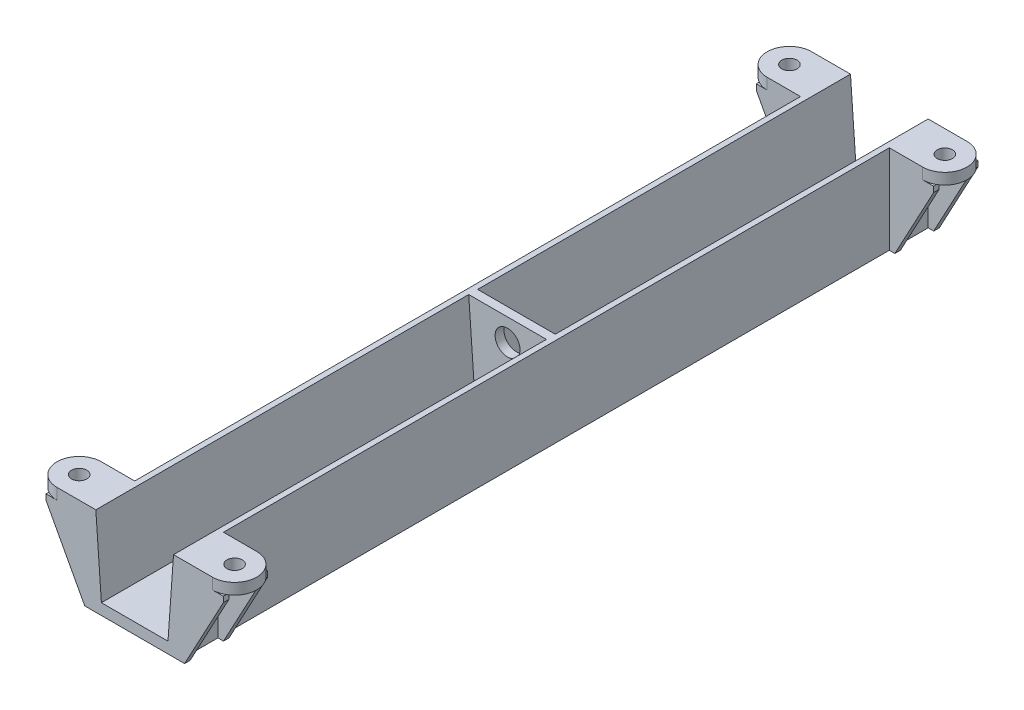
ISO-10303-21;
HEADER;
FILE_DESCRIPTION(('STEP AP214'),'2;1');
FILE_NAME('part.step','',(''),(''),'','','');
FILE_SCHEMA(('AUTOMOTIVE_DESIGN { 1 0 10303 214 1 1 1 1 }'));
ENDSEC;
DATA;
#1=APPLICATION_CONTEXT('core data for automotive mechanical design processes');
#2=APPLICATION_PROTOCOL_DEFINITION('international standard','automotive_design',2000,#1);
#3=PRODUCT_CONTEXT('',#1,'mechanical');
#4=PRODUCT('Part','Part','',(#3));
#5=PRODUCT_RELATED_PRODUCT_CATEGORY('part','',(#4));
#6=PRODUCT_DEFINITION_FORMATION('','',#4);
#7=PRODUCT_DEFINITION_CONTEXT('part definition',#1,'design');
#8=PRODUCT_DEFINITION('design','',#6,#7);
#9=PRODUCT_DEFINITION_SHAPE('','',#8);
#10=(LENGTH_UNIT() NAMED_UNIT(*) SI_UNIT(.MILLI.,.METRE.));
#11=(NAMED_UNIT(*) PLANE_ANGLE_UNIT() SI_UNIT($,.RADIAN.));
#12=(NAMED_UNIT(*) SI_UNIT($,.STERADIAN.) SOLID_ANGLE_UNIT());
#13=UNCERTAINTY_MEASURE_WITH_UNIT(LENGTH_MEASURE(1.E-05),#10,'distance_accuracy_value','');
#14=(GEOMETRIC_REPRESENTATION_CONTEXT(3) GLOBAL_UNCERTAINTY_ASSIGNED_CONTEXT((#13)) GLOBAL_UNIT_ASSIGNED_CONTEXT((#10,
#11,#12)) REPRESENTATION_CONTEXT('',''));
#15=CARTESIAN_POINT('',(0.,0.,0.));
#16=DIRECTION('',(0.,0.,1.));
#17=DIRECTION('',(1.,0.,0.));
#18=AXIS2_PLACEMENT_3D('',#15,#16,#17);
#19=CARTESIAN_POINT('',(22.225,50.8,215.9));
#20=DIRECTION('',(0.997458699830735,-0.0712470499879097,0.));
#21=DIRECTION('',(0.0712470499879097,0.997458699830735,0.));
#22=AXIS2_PLACEMENT_3D('',#19,#20,#21);
#23=PLANE('',#22);
#24=DIRECTION('',(0.0712470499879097,0.997458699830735,0.));
#25=VECTOR('',#24,1.);
#26=CARTESIAN_POINT('',(22.225,50.8,2.54));
#27=LINE('',#26,#25);
#28=CARTESIAN_POINT('',(19.05,6.35,2.54));
#29=VERTEX_POINT('',#28);
#30=CARTESIAN_POINT('',(22.225,50.8,2.54));
#31=VERTEX_POINT('',#30);
#32=EDGE_CURVE('E1594',#29,#31,#27,.T.);
#33=ORIENTED_EDGE('',*,*,#32,.F.);
#34=DIRECTION('',(0.,0.,-1.));
#35=VECTOR('',#34,1.);
#36=CARTESIAN_POINT('',(19.05,6.35,215.9));
#37=LINE('',#36,#35);
#38=CARTESIAN_POINT('',(19.05,6.35,215.9));
#39=VERTEX_POINT('',#38);
#40=EDGE_CURVE('E735',#39,#29,#37,.T.);
#41=ORIENTED_EDGE('',*,*,#40,.F.);
#42=DIRECTION('',(-0.0712470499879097,-0.997458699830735,0.));
#43=VECTOR('',#42,1.);
#44=CARTESIAN_POINT('',(22.225,50.8,215.9));
#45=LINE('',#44,#43);
#46=CARTESIAN_POINT('',(22.225,50.8,215.9));
#47=VERTEX_POINT('',#46);
#48=EDGE_CURVE('E800',#47,#39,#45,.T.);
#49=ORIENTED_EDGE('',*,*,#48,.F.);
#50=DIRECTION('',(0.,0.,-1.));
#51=VECTOR('',#50,1.);
#52=CARTESIAN_POINT('',(22.225,50.8,215.9));
#53=LINE('',#52,#51);
#54=EDGE_CURVE('E744',#47,#31,#53,.T.);
#55=ORIENTED_EDGE('',*,*,#54,.T.);
#56=EDGE_LOOP('',(#33,#41,#49,#55));
#57=FACE_BOUND('',#56,.T.);
#58=ADVANCED_FACE('F361',(#57),#23,.F.);
#59=CARTESIAN_POINT('',(-19.05,6.35,215.9));
#60=DIRECTION('',(0.,-1.,0.));
#61=DIRECTION('',(0.,0.,-1.));
#62=AXIS2_PLACEMENT_3D('',#59,#60,#61);
#63=PLANE('',#62);
#64=DIRECTION('',(1.,0.,0.));
#65=VECTOR('',#64,1.);
#66=CARTESIAN_POINT('',(19.05,6.35,2.54));
#67=LINE('',#66,#65);
#68=CARTESIAN_POINT('',(-19.05,6.35,2.54));
#69=VERTEX_POINT('',#68);
#70=EDGE_CURVE('E1592',#69,#29,#67,.T.);
#71=ORIENTED_EDGE('',*,*,#70,.F.);
#72=DIRECTION('',(0.,0.,-1.));
#73=VECTOR('',#72,1.);
#74=CARTESIAN_POINT('',(-19.05,6.35,215.9));
#75=LINE('',#74,#73);
#76=CARTESIAN_POINT('',(-19.05,6.35,215.9));
#77=VERTEX_POINT('',#76);
#78=EDGE_CURVE('E736',#77,#69,#75,.T.);
#79=ORIENTED_EDGE('',*,*,#78,.F.);
#80=DIRECTION('',(-1.,0.,0.));
#81=VECTOR('',#80,1.);
#82=CARTESIAN_POINT('',(-19.05,6.35,215.9));
#83=LINE('',#82,#81);
#84=EDGE_CURVE('E802',#39,#77,#83,.T.);
#85=ORIENTED_EDGE('',*,*,#84,.F.);
#86=ORIENTED_EDGE('',*,*,#40,.T.);
#87=EDGE_LOOP('',(#71,#79,#85,#86));
#88=FACE_BOUND('',#87,.T.);
#89=ADVANCED_FACE('F931',(#88),#63,.F.);
#90=CARTESIAN_POINT('',(-22.225,50.8,215.9));
#91=DIRECTION('',(-0.997458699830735,-0.0712470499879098,0.));
#92=DIRECTION('',(0.0712470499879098,-0.997458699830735,0.));
#93=AXIS2_PLACEMENT_3D('',#90,#91,#92);
#94=PLANE('',#93);
#95=DIRECTION('',(0.0712470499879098,-0.997458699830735,0.));
#96=VECTOR('',#95,1.);
#97=CARTESIAN_POINT('',(-19.05,6.35,2.54));
#98=LINE('',#97,#96);
#99=CARTESIAN_POINT('',(-22.225,50.8,2.54));
#100=VERTEX_POINT('',#99);
#101=EDGE_CURVE('E1590',#100,#69,#98,.T.);
#102=ORIENTED_EDGE('',*,*,#101,.F.);
#103=DIRECTION('',(0.,0.,-1.));
#104=VECTOR('',#103,1.);
#105=CARTESIAN_POINT('',(-22.225,50.8,215.9));
#106=LINE('',#105,#104);
#107=CARTESIAN_POINT('',(-22.225,50.8,215.9));
#108=VERTEX_POINT('',#107);
#109=EDGE_CURVE('E806',#108,#100,#106,.T.);
#110=ORIENTED_EDGE('',*,*,#109,.F.);
#111=DIRECTION('',(-0.0712470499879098,0.997458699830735,0.));
#112=VECTOR('',#111,1.);
#113=CARTESIAN_POINT('',(-22.225,50.8,215.9));
#114=LINE('',#113,#112);
#115=EDGE_CURVE('E804',#77,#108,#114,.T.);
#116=ORIENTED_EDGE('',*,*,#115,.F.);
#117=ORIENTED_EDGE('',*,*,#78,.T.);
#118=EDGE_LOOP('',(#102,#110,#116,#117));
#119=FACE_BOUND('',#118,.T.);
#120=ADVANCED_FACE('F938',(#119),#94,.F.);
#121=CARTESIAN_POINT('',(-25.4,50.8,215.9));
#122=DIRECTION('',(1.,0.,0.));
#123=DIRECTION('',(0.,1.,0.));
#124=AXIS2_PLACEMENT_3D('',#121,#122,#123);
#125=PLANE('',#124);
#126=DIRECTION('',(0.,0.,-1.));
#127=VECTOR('',#126,1.);
#128=CARTESIAN_POINT('',(-25.4,0.,215.9));
#129=LINE('',#128,#127);
#130=CARTESIAN_POINT('',(-25.4,0.,190.5));
#131=VERTEX_POINT('',#130);
#132=CARTESIAN_POINT('',(-25.4,0.,-190.5));
#133=VERTEX_POINT('',#132);
#134=EDGE_CURVE('E1637',#131,#133,#129,.T.);
#135=ORIENTED_EDGE('',*,*,#134,.F.);
#136=DIRECTION('',(0.,1.,0.));
#137=VECTOR('',#136,1.);
#138=CARTESIAN_POINT('',(-25.4,44.45,190.5));
#139=LINE('',#138,#137);
#140=CARTESIAN_POINT('',(-25.4,50.8,190.5));
#141=VERTEX_POINT('',#140);
#142=EDGE_CURVE('E1032',#131,#141,#139,.T.);
#143=ORIENTED_EDGE('',*,*,#142,.T.);
#144=DIRECTION('',(0.,0.,-1.));
#145=VECTOR('',#144,1.);
#146=CARTESIAN_POINT('',(-25.4,50.8,215.9));
#147=LINE('',#146,#145);
#148=CARTESIAN_POINT('',(-25.4,50.8,-190.5));
#149=VERTEX_POINT('',#148);
#150=EDGE_CURVE('E11',#141,#149,#147,.T.);
#151=ORIENTED_EDGE('',*,*,#150,.T.);
#152=DIRECTION('',(0.,1.,0.));
#153=VECTOR('',#152,1.);
#154=CARTESIAN_POINT('',(-25.4,44.45,-190.5));
#155=LINE('',#154,#153);
#156=EDGE_CURVE('E1209',#133,#149,#155,.T.);
#157=ORIENTED_EDGE('',*,*,#156,.F.);
#158=EDGE_LOOP('',(#135,#143,#151,#157));
#159=FACE_BOUND('',#158,.T.);
#160=ADVANCED_FACE('F1376',(#159),#125,.F.);
#161=CARTESIAN_POINT('',(-44.45,44.45,203.2));
#162=DIRECTION('',(0.,1.,0.));
#163=DIRECTION('',(0.,0.,-1.));
#164=AXIS2_PLACEMENT_3D('',#161,#162,#163);
#165=PLANE('',#164);
#166=CARTESIAN_POINT('',(-44.45,44.45,203.2));
#167=DIRECTION('',(0.,1.,0.));
#168=DIRECTION('',(0.,0.,-1.));
#169=AXIS2_PLACEMENT_3D('',#166,#167,#168);
#170=CIRCLE('',#169,4.3688);
#171=CARTESIAN_POINT('',(-44.45,44.45,198.8312));
#172=VERTEX_POINT('',#171);
#173=EDGE_CURVE('E1016',#172,#172,#170,.T.);
#174=ORIENTED_EDGE('',*,*,#173,.T.);
#175=EDGE_LOOP('',(#174));
#176=FACE_BOUND('',#175,.T.);
#177=DIRECTION('',(0.,0.,-1.));
#178=VECTOR('',#177,1.);
#179=CARTESIAN_POINT('',(-50.739051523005,44.45,193.675));
#180=LINE('',#179,#178);
#181=CARTESIAN_POINT('',(-50.739051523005,44.45,193.675));
#182=VERTEX_POINT('',#181);
#183=CARTESIAN_POINT('',(-50.739051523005,44.45,192.166513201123));
#184=VERTEX_POINT('',#183);
#185=EDGE_CURVE('E1619',#182,#184,#180,.T.);
#186=ORIENTED_EDGE('',*,*,#185,.F.);
#187=DIRECTION('',(-1.,0.,0.));
#188=VECTOR('',#187,1.);
#189=CARTESIAN_POINT('',(-50.739051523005,44.45,193.675));
#190=LINE('',#189,#188);
#191=CARTESIAN_POINT('',(-25.4,44.45,193.675));
#192=VERTEX_POINT('',#191);
#193=EDGE_CURVE('E1616',#192,#182,#190,.T.);
#194=ORIENTED_EDGE('',*,*,#193,.F.);
#195=DIRECTION('',(0.,0.,-1.));
#196=VECTOR('',#195,1.);
#197=CARTESIAN_POINT('',(-25.4,44.45,215.9));
#198=LINE('',#197,#196);
#199=CARTESIAN_POINT('',(-25.4,44.45,212.725));
#200=VERTEX_POINT('',#199);
#201=EDGE_CURVE('E1025',#200,#192,#198,.T.);
#202=ORIENTED_EDGE('',*,*,#201,.F.);
#203=DIRECTION('',(-1.,0.,0.));
#204=VECTOR('',#203,1.);
#205=CARTESIAN_POINT('',(-50.739051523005,44.45,212.725));
#206=LINE('',#205,#204);
#207=CARTESIAN_POINT('',(-50.739051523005,44.45,212.725));
#208=VERTEX_POINT('',#207);
#209=EDGE_CURVE('E995',#200,#208,#206,.T.);
#210=ORIENTED_EDGE('',*,*,#209,.T.);
#211=DIRECTION('',(0.,0.,1.));
#212=VECTOR('',#211,1.);
#213=CARTESIAN_POINT('',(-50.739051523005,44.45,212.725));
#214=LINE('',#213,#212);
#215=CARTESIAN_POINT('',(-50.739051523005,44.45,214.233486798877));
#216=VERTEX_POINT('',#215);
#217=EDGE_CURVE('E1011',#208,#216,#214,.T.);
#218=ORIENTED_EDGE('',*,*,#217,.T.);
#219=CARTESIAN_POINT('',(-44.45,44.45,203.2));
#220=DIRECTION('',(0.,1.,0.));
#221=DIRECTION('',(0.,0.,-1.));
#222=AXIS2_PLACEMENT_3D('',#219,#220,#221);
#223=CIRCLE('',#222,12.7);
#224=EDGE_CURVE('E1033',#184,#216,#223,.T.);
#225=ORIENTED_EDGE('',*,*,#224,.F.);
#226=EDGE_LOOP('',(#186,#194,#202,#210,#218,#225));
#227=FACE_BOUND('',#226,.T.);
#228=ADVANCED_FACE('F1532',(#176,#227),#165,.F.);
#229=CARTESIAN_POINT('',(25.4,50.8,215.9));
#230=DIRECTION('',(-1.,0.,0.));
#231=DIRECTION('',(0.,-1.,0.));
#232=AXIS2_PLACEMENT_3D('',#229,#230,#231);
#233=PLANE('',#232);
#234=DIRECTION('',(0.,1.,0.));
#235=VECTOR('',#234,1.);
#236=CARTESIAN_POINT('',(25.4,44.45,190.5));
#237=LINE('',#236,#235);
#238=CARTESIAN_POINT('',(25.4,0.,190.5));
#239=VERTEX_POINT('',#238);
#240=CARTESIAN_POINT('',(25.4,50.8,190.5));
#241=VERTEX_POINT('',#240);
#242=EDGE_CURVE('E1119',#239,#241,#237,.T.);
#243=ORIENTED_EDGE('',*,*,#242,.F.);
#244=DIRECTION('',(0.,0.,-1.));
#245=VECTOR('',#244,1.);
#246=CARTESIAN_POINT('',(25.4,0.,215.9));
#247=LINE('',#246,#245);
#248=CARTESIAN_POINT('',(25.4,0.,-190.5));
#249=VERTEX_POINT('',#248);
#250=EDGE_CURVE('E1294',#239,#249,#247,.T.);
#251=ORIENTED_EDGE('',*,*,#250,.T.);
#252=DIRECTION('',(0.,1.,0.));
#253=VECTOR('',#252,1.);
#254=CARTESIAN_POINT('',(25.4,44.45,-190.5));
#255=LINE('',#254,#253);
#256=CARTESIAN_POINT('',(25.4,50.8,-190.5));
#257=VERTEX_POINT('',#256);
#258=EDGE_CURVE('E768',#249,#257,#255,.T.);
#259=ORIENTED_EDGE('',*,*,#258,.T.);
#260=DIRECTION('',(0.,0.,-1.));
#261=VECTOR('',#260,1.);
#262=CARTESIAN_POINT('',(25.4,50.8,215.9));
#263=LINE('',#262,#261);
#264=EDGE_CURVE('E747',#241,#257,#263,.T.);
#265=ORIENTED_EDGE('',*,*,#264,.F.);
#266=EDGE_LOOP('',(#243,#251,#259,#265));
#267=FACE_BOUND('',#266,.T.);
#268=ADVANCED_FACE('F956',(#267),#233,.F.);
#269=CARTESIAN_POINT('',(44.45,44.45,203.2));
#270=DIRECTION('',(0.,1.,0.));
#271=DIRECTION('',(0.,0.,-1.));
#272=AXIS2_PLACEMENT_3D('',#269,#270,#271);
#273=PLANE('',#272);
#274=CARTESIAN_POINT('',(44.45,44.45,203.2));
#275=DIRECTION('',(0.,-1.,0.));
#276=DIRECTION('',(0.,0.,-1.));
#277=AXIS2_PLACEMENT_3D('',#274,#275,#276);
#278=CIRCLE('',#277,4.3688);
#279=CARTESIAN_POINT('',(44.45,44.45,198.8312));
#280=VERTEX_POINT('',#279);
#281=EDGE_CURVE('E1103',#280,#280,#278,.T.);
#282=ORIENTED_EDGE('',*,*,#281,.F.);
#283=EDGE_LOOP('',(#282));
#284=FACE_BOUND('',#283,.T.);
#285=DIRECTION('',(1.,0.,0.));
#286=VECTOR('',#285,1.);
#287=CARTESIAN_POINT('',(50.739051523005,44.45,193.675));
#288=LINE('',#287,#286);
#289=CARTESIAN_POINT('',(25.4,44.45,193.675));
#290=VERTEX_POINT('',#289);
#291=CARTESIAN_POINT('',(50.739051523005,44.45,193.675));
#292=VERTEX_POINT('',#291);
#293=EDGE_CURVE('E385',#290,#292,#288,.T.);
#294=ORIENTED_EDGE('',*,*,#293,.T.);
#295=DIRECTION('',(0.,0.,-1.));
#296=VECTOR('',#295,1.);
#297=CARTESIAN_POINT('',(50.739051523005,44.45,193.675));
#298=LINE('',#297,#296);
#299=CARTESIAN_POINT('',(50.739051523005,44.45,192.166513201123));
#300=VERTEX_POINT('',#299);
#301=EDGE_CURVE('E1071',#292,#300,#298,.T.);
#302=ORIENTED_EDGE('',*,*,#301,.T.);
#303=CARTESIAN_POINT('',(44.45,44.45,203.2));
#304=DIRECTION('',(0.,-1.,0.));
#305=DIRECTION('',(0.,0.,-1.));
#306=AXIS2_PLACEMENT_3D('',#303,#304,#305);
#307=CIRCLE('',#306,12.7);
#308=CARTESIAN_POINT('',(50.739051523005,44.45,214.233486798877));
#309=VERTEX_POINT('',#308);
#310=EDGE_CURVE('E1118',#300,#309,#307,.T.);
#311=ORIENTED_EDGE('',*,*,#310,.T.);
#312=DIRECTION('',(0.,0.,1.));
#313=VECTOR('',#312,1.);
#314=CARTESIAN_POINT('',(50.739051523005,44.45,212.725));
#315=LINE('',#314,#313);
#316=CARTESIAN_POINT('',(50.739051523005,44.45,212.725));
#317=VERTEX_POINT('',#316);
#318=EDGE_CURVE('E1092',#317,#309,#315,.T.);
#319=ORIENTED_EDGE('',*,*,#318,.F.);
#320=DIRECTION('',(1.,0.,0.));
#321=VECTOR('',#320,1.);
#322=CARTESIAN_POINT('',(50.739051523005,44.45,212.725));
#323=LINE('',#322,#321);
#324=CARTESIAN_POINT('',(25.4,44.45,212.725));
#325=VERTEX_POINT('',#324);
#326=EDGE_CURVE('E1089',#325,#317,#323,.T.);
#327=ORIENTED_EDGE('',*,*,#326,.F.);
#328=DIRECTION('',(0.,0.,-1.));
#329=VECTOR('',#328,1.);
#330=CARTESIAN_POINT('',(25.4,44.45,215.9));
#331=LINE('',#330,#329);
#332=EDGE_CURVE('E1111',#325,#290,#331,.T.);
#333=ORIENTED_EDGE('',*,*,#332,.T.);
#334=EDGE_LOOP('',(#294,#302,#311,#319,#327,#333));
#335=FACE_BOUND('',#334,.T.);
#336=ADVANCED_FACE('F1484',(#284,#335),#273,.F.);
#337=CARTESIAN_POINT('',(25.4,0.,212.725));
#338=VERTEX_POINT('',#337);
#339=CARTESIAN_POINT('',(25.4,0.,193.675));
#340=VERTEX_POINT('',#339);
#341=EDGE_CURVE('E750',#338,#340,#247,.T.);
#342=ORIENTED_EDGE('',*,*,#341,.T.);
#343=DIRECTION('',(0.,1.,0.));
#344=VECTOR('',#343,1.);
#345=CARTESIAN_POINT('',(25.4,44.45,193.675));
#346=LINE('',#345,#344);
#347=EDGE_CURVE('E1053',#340,#290,#346,.T.);
#348=ORIENTED_EDGE('',*,*,#347,.T.);
#349=ORIENTED_EDGE('',*,*,#332,.F.);
#350=DIRECTION('',(0.,1.,0.));
#351=VECTOR('',#350,1.);
#352=CARTESIAN_POINT('',(25.4,44.45,212.725));
#353=LINE('',#352,#351);
#354=EDGE_CURVE('E1079',#338,#325,#353,.T.);
#355=ORIENTED_EDGE('',*,*,#354,.F.);
#356=EDGE_LOOP('',(#342,#348,#349,#355));
#357=FACE_BOUND('',#356,.T.);
#358=ADVANCED_FACE('F957',(#357),#233,.F.);
#359=ORIENTED_EDGE('',*,*,#201,.T.);
#360=DIRECTION('',(0.,1.,0.));
#361=VECTOR('',#360,1.);
#362=CARTESIAN_POINT('',(-25.4,44.45,193.675));
#363=LINE('',#362,#361);
#364=CARTESIAN_POINT('',(-25.4,0.,193.675));
#365=VERTEX_POINT('',#364);
#366=EDGE_CURVE('E1608',#365,#192,#363,.T.);
#367=ORIENTED_EDGE('',*,*,#366,.F.);
#368=CARTESIAN_POINT('',(-25.4,0.,212.725));
#369=VERTEX_POINT('',#368);
#370=EDGE_CURVE('E370',#369,#365,#129,.T.);
#371=ORIENTED_EDGE('',*,*,#370,.F.);
#372=DIRECTION('',(0.,1.,0.));
#373=VECTOR('',#372,1.);
#374=CARTESIAN_POINT('',(-25.4,44.45,212.725));
#375=LINE('',#374,#373);
#376=EDGE_CURVE('E992',#369,#200,#375,.T.);
#377=ORIENTED_EDGE('',*,*,#376,.T.);
#378=EDGE_LOOP('',(#359,#367,#371,#377));
#379=FACE_BOUND('',#378,.T.);
#380=ADVANCED_FACE('F1377',(#379),#125,.F.);
#381=CARTESIAN_POINT('',(-44.45,44.45,-203.2));
#382=DIRECTION('',(0.,1.,0.));
#383=DIRECTION('',(0.,0.,1.));
#384=AXIS2_PLACEMENT_3D('',#381,#382,#383);
#385=PLANE('',#384);
#386=CARTESIAN_POINT('',(-44.45,44.45,-203.2));
#387=DIRECTION('',(0.,-1.,0.));
#388=DIRECTION('',(0.,0.,1.));
#389=AXIS2_PLACEMENT_3D('',#386,#387,#388);
#390=CIRCLE('',#389,4.3688);
#391=CARTESIAN_POINT('',(-44.45,44.45,-198.8312));
#392=VERTEX_POINT('',#391);
#393=EDGE_CURVE('E1194',#392,#392,#390,.T.);
#394=ORIENTED_EDGE('',*,*,#393,.F.);
#395=EDGE_LOOP('',(#394));
#396=FACE_BOUND('',#395,.T.);
#397=DIRECTION('',(-1.,0.,0.));
#398=VECTOR('',#397,1.);
#399=CARTESIAN_POINT('',(-50.739051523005,44.45,-193.675));
#400=LINE('',#399,#398);
#401=CARTESIAN_POINT('',(-25.4,44.45,-193.675));
#402=VERTEX_POINT('',#401);
#403=CARTESIAN_POINT('',(-50.739051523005,44.45,-193.675));
#404=VERTEX_POINT('',#403);
#405=EDGE_CURVE('E1141',#402,#404,#400,.T.);
#406=ORIENTED_EDGE('',*,*,#405,.T.);
#407=DIRECTION('',(0.,0.,1.));
#408=VECTOR('',#407,1.);
#409=CARTESIAN_POINT('',(-50.739051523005,44.45,-193.675));
#410=LINE('',#409,#408);
#411=CARTESIAN_POINT('',(-50.739051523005,44.45,-192.166513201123));
#412=VERTEX_POINT('',#411);
#413=EDGE_CURVE('E1158',#404,#412,#410,.T.);
#414=ORIENTED_EDGE('',*,*,#413,.T.);
#415=CARTESIAN_POINT('',(-44.45,44.45,-203.2));
#416=DIRECTION('',(0.,-1.,0.));
#417=DIRECTION('',(0.,0.,1.));
#418=AXIS2_PLACEMENT_3D('',#415,#416,#417);
#419=CIRCLE('',#418,12.7);
#420=CARTESIAN_POINT('',(-50.739051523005,44.45,-214.233486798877));
#421=VERTEX_POINT('',#420);
#422=EDGE_CURVE('E1203',#412,#421,#419,.T.);
#423=ORIENTED_EDGE('',*,*,#422,.T.);
#424=DIRECTION('',(0.,0.,-1.));
#425=VECTOR('',#424,1.);
#426=CARTESIAN_POINT('',(-50.739051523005,44.45,-212.725));
#427=LINE('',#426,#425);
#428=CARTESIAN_POINT('',(-50.739051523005,44.45,-212.725));
#429=VERTEX_POINT('',#428);
#430=EDGE_CURVE('E1182',#429,#421,#427,.T.);
#431=ORIENTED_EDGE('',*,*,#430,.F.);
#432=DIRECTION('',(-1.,0.,0.));
#433=VECTOR('',#432,1.);
#434=CARTESIAN_POINT('',(-50.739051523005,44.45,-212.725));
#435=LINE('',#434,#433);
#436=CARTESIAN_POINT('',(-25.4,44.45,-212.725));
#437=VERTEX_POINT('',#436);
#438=EDGE_CURVE('E1178',#437,#429,#435,.T.);
#439=ORIENTED_EDGE('',*,*,#438,.F.);
#440=DIRECTION('',(0.,0.,1.));
#441=VECTOR('',#440,1.);
#442=CARTESIAN_POINT('',(-25.4,44.45,-215.9));
#443=LINE('',#442,#441);
#444=EDGE_CURVE('E755',#437,#402,#443,.T.);
#445=ORIENTED_EDGE('',*,*,#444,.T.);
#446=EDGE_LOOP('',(#406,#414,#423,#431,#439,#445));
#447=FACE_BOUND('',#446,.T.);
#448=ADVANCED_FACE('F1227',(#396,#447),#385,.F.);
#449=CARTESIAN_POINT('',(-25.4,0.,-193.675));
#450=VERTEX_POINT('',#449);
#451=CARTESIAN_POINT('',(-25.4,0.,-212.725));
#452=VERTEX_POINT('',#451);
#453=EDGE_CURVE('E1245',#450,#452,#129,.T.);
#454=ORIENTED_EDGE('',*,*,#453,.F.);
#455=DIRECTION('',(0.,1.,0.));
#456=VECTOR('',#455,1.);
#457=CARTESIAN_POINT('',(-25.4,44.45,-193.675));
#458=LINE('',#457,#456);
#459=EDGE_CURVE('E1139',#450,#402,#458,.T.);
#460=ORIENTED_EDGE('',*,*,#459,.T.);
#461=ORIENTED_EDGE('',*,*,#444,.F.);
#462=DIRECTION('',(0.,1.,0.));
#463=VECTOR('',#462,1.);
#464=CARTESIAN_POINT('',(-25.4,44.45,-212.725));
#465=LINE('',#464,#463);
#466=EDGE_CURVE('E1168',#452,#437,#465,.T.);
#467=ORIENTED_EDGE('',*,*,#466,.F.);
#468=EDGE_LOOP('',(#454,#460,#461,#467));
#469=FACE_BOUND('',#468,.T.);
#470=ADVANCED_FACE('F363',(#469),#125,.F.);
#471=CARTESIAN_POINT('',(44.45,44.45,-203.2));
#472=DIRECTION('',(0.,1.,0.));
#473=DIRECTION('',(0.,0.,1.));
#474=AXIS2_PLACEMENT_3D('',#471,#472,#473);
#475=PLANE('',#474);
#476=CARTESIAN_POINT('',(44.45,44.45,-203.2));
#477=DIRECTION('',(0.,1.,0.));
#478=DIRECTION('',(0.,0.,1.));
#479=AXIS2_PLACEMENT_3D('',#476,#477,#478);
#480=CIRCLE('',#479,4.3688);
#481=CARTESIAN_POINT('',(44.45,44.45,-198.8312));
#482=VERTEX_POINT('',#481);
#483=EDGE_CURVE('E765',#482,#482,#480,.T.);
#484=ORIENTED_EDGE('',*,*,#483,.T.);
#485=EDGE_LOOP('',(#484));
#486=FACE_BOUND('',#485,.T.);
#487=DIRECTION('',(0.,0.,1.));
#488=VECTOR('',#487,1.);
#489=CARTESIAN_POINT('',(50.739051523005,44.45,-193.675));
#490=LINE('',#489,#488);
#491=CARTESIAN_POINT('',(50.739051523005,44.45,-193.675));
#492=VERTEX_POINT('',#491);
#493=CARTESIAN_POINT('',(50.739051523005,44.45,-192.166513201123));
#494=VERTEX_POINT('',#493);
#495=EDGE_CURVE('E858',#492,#494,#490,.T.);
#496=ORIENTED_EDGE('',*,*,#495,.F.);
#497=DIRECTION('',(1.,0.,0.));
#498=VECTOR('',#497,1.);
#499=CARTESIAN_POINT('',(50.739051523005,44.45,-193.675));
#500=LINE('',#499,#498);
#501=CARTESIAN_POINT('',(25.4,44.45,-193.675));
#502=VERTEX_POINT('',#501);
#503=EDGE_CURVE('E1279',#502,#492,#500,.T.);
#504=ORIENTED_EDGE('',*,*,#503,.F.);
#505=DIRECTION('',(0.,0.,1.));
#506=VECTOR('',#505,1.);
#507=CARTESIAN_POINT('',(25.4,44.45,-215.9));
#508=LINE('',#507,#506);
#509=CARTESIAN_POINT('',(25.4,44.45,-212.725));
#510=VERTEX_POINT('',#509);
#511=EDGE_CURVE('E833',#510,#502,#508,.T.);
#512=ORIENTED_EDGE('',*,*,#511,.F.);
#513=DIRECTION('',(1.,0.,0.));
#514=VECTOR('',#513,1.);
#515=CARTESIAN_POINT('',(50.739051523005,44.45,-212.725));
#516=LINE('',#515,#514);
#517=CARTESIAN_POINT('',(50.739051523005,44.45,-212.725));
#518=VERTEX_POINT('',#517);
#519=EDGE_CURVE('E895',#510,#518,#516,.T.);
#520=ORIENTED_EDGE('',*,*,#519,.T.);
#521=DIRECTION('',(0.,0.,-1.));
#522=VECTOR('',#521,1.);
#523=CARTESIAN_POINT('',(50.739051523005,44.45,-212.725));
#524=LINE('',#523,#522);
#525=CARTESIAN_POINT('',(50.739051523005,44.45,-214.233486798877));
#526=VERTEX_POINT('',#525);
#527=EDGE_CURVE('E872',#518,#526,#524,.T.);
#528=ORIENTED_EDGE('',*,*,#527,.T.);
#529=CARTESIAN_POINT('',(44.45,44.45,-203.2));
#530=DIRECTION('',(0.,1.,0.));
#531=DIRECTION('',(0.,0.,1.));
#532=AXIS2_PLACEMENT_3D('',#529,#530,#531);
#533=CIRCLE('',#532,12.7);
#534=EDGE_CURVE('E841',#494,#526,#533,.T.);
#535=ORIENTED_EDGE('',*,*,#534,.F.);
#536=EDGE_LOOP('',(#496,#504,#512,#520,#528,#535));
#537=FACE_BOUND('',#536,.T.);
#538=ADVANCED_FACE('F870',(#486,#537),#475,.F.);
#539=CARTESIAN_POINT('',(-25.4,0.,215.9));
#540=DIRECTION('',(0.,1.,0.));
#541=DIRECTION('',(0.,0.,1.));
#542=AXIS2_PLACEMENT_3D('',#539,#540,#541);
#543=PLANE('',#542);
#544=DIRECTION('',(1.,0.,0.));
#545=VECTOR('',#544,1.);
#546=CARTESIAN_POINT('',(-25.4,0.,215.9));
#547=LINE('',#546,#545);
#548=CARTESIAN_POINT('',(-28.575,0.,215.9));
#549=VERTEX_POINT('',#548);
#550=CARTESIAN_POINT('',(28.575,0.,215.9));
#551=VERTEX_POINT('',#550);
#552=EDGE_CURVE('E796',#549,#551,#547,.T.);
#553=ORIENTED_EDGE('',*,*,#552,.F.);
#554=DIRECTION('',(0.,0.,1.));
#555=VECTOR('',#554,1.);
#556=CARTESIAN_POINT('',(-28.575,0.,212.725));
#557=LINE('',#556,#555);
#558=CARTESIAN_POINT('',(-28.575,0.,212.725));
#559=VERTEX_POINT('',#558);
#560=EDGE_CURVE('E968',#559,#549,#557,.T.);
#561=ORIENTED_EDGE('',*,*,#560,.F.);
#562=DIRECTION('',(1.,0.,0.));
#563=VECTOR('',#562,1.);
#564=CARTESIAN_POINT('',(-25.4,0.,212.725));
#565=LINE('',#564,#563);
#566=EDGE_CURVE('E1007',#559,#369,#565,.T.);
#567=ORIENTED_EDGE('',*,*,#566,.T.);
#568=ORIENTED_EDGE('',*,*,#370,.T.);
#569=DIRECTION('',(1.,0.,0.));
#570=VECTOR('',#569,1.);
#571=CARTESIAN_POINT('',(-25.4,0.,193.675));
#572=LINE('',#571,#570);
#573=CARTESIAN_POINT('',(-28.575,0.,193.675));
#574=VERTEX_POINT('',#573);
#575=EDGE_CURVE('E1610',#574,#365,#572,.T.);
#576=ORIENTED_EDGE('',*,*,#575,.F.);
#577=DIRECTION('',(0.,0.,-1.));
#578=VECTOR('',#577,1.);
#579=CARTESIAN_POINT('',(-28.575,0.,193.675));
#580=LINE('',#579,#578);
#581=CARTESIAN_POINT('',(-28.575,0.,190.5));
#582=VERTEX_POINT('',#581);
#583=EDGE_CURVE('E1618',#574,#582,#580,.T.);
#584=ORIENTED_EDGE('',*,*,#583,.T.);
#585=DIRECTION('',(1.,0.,0.));
#586=VECTOR('',#585,1.);
#587=CARTESIAN_POINT('',(-25.4,0.,190.5));
#588=LINE('',#587,#586);
#589=EDGE_CURVE('E1598',#582,#131,#588,.T.);
#590=ORIENTED_EDGE('',*,*,#589,.T.);
#591=ORIENTED_EDGE('',*,*,#134,.T.);
#592=DIRECTION('',(1.,0.,0.));
#593=VECTOR('',#592,1.);
#594=CARTESIAN_POINT('',(-25.4,0.,-190.5));
#595=LINE('',#594,#593);
#596=CARTESIAN_POINT('',(-28.575,0.,-190.5));
#597=VERTEX_POINT('',#596);
#598=EDGE_CURVE('E1136',#597,#133,#595,.T.);
#599=ORIENTED_EDGE('',*,*,#598,.F.);
#600=DIRECTION('',(0.,0.,1.));
#601=VECTOR('',#600,1.);
#602=CARTESIAN_POINT('',(-28.575,0.,-193.675));
#603=LINE('',#602,#601);
#604=CARTESIAN_POINT('',(-28.575,0.,-193.675));
#605=VERTEX_POINT('',#604);
#606=EDGE_CURVE('E1153',#605,#597,#603,.T.);
#607=ORIENTED_EDGE('',*,*,#606,.F.);
#608=DIRECTION('',(1.,0.,0.));
#609=VECTOR('',#608,1.);
#610=CARTESIAN_POINT('',(-25.4,0.,-193.675));
#611=LINE('',#610,#609);
#612=EDGE_CURVE('E1149',#605,#450,#611,.T.);
#613=ORIENTED_EDGE('',*,*,#612,.T.);
#614=ORIENTED_EDGE('',*,*,#453,.T.);
#615=DIRECTION('',(1.,0.,0.));
#616=VECTOR('',#615,1.);
#617=CARTESIAN_POINT('',(-25.4,0.,-212.725));
#618=LINE('',#617,#616);
#619=CARTESIAN_POINT('',(-28.575,0.,-212.725));
#620=VERTEX_POINT('',#619);
#621=EDGE_CURVE('E1171',#620,#452,#618,.T.);
#622=ORIENTED_EDGE('',*,*,#621,.F.);
#623=DIRECTION('',(0.,0.,-1.));
#624=VECTOR('',#623,1.);
#625=CARTESIAN_POINT('',(-28.575,0.,-212.725));
#626=LINE('',#625,#624);
#627=CARTESIAN_POINT('',(-28.575,0.,-215.9));
#628=VERTEX_POINT('',#627);
#629=EDGE_CURVE('E1181',#620,#628,#626,.T.);
#630=ORIENTED_EDGE('',*,*,#629,.T.);
#631=DIRECTION('',(1.,0.,0.));
#632=VECTOR('',#631,1.);
#633=CARTESIAN_POINT('',(-25.4,0.,-215.9));
#634=LINE('',#633,#632);
#635=CARTESIAN_POINT('',(28.575,0.,-215.9));
#636=VERTEX_POINT('',#635);
#637=EDGE_CURVE('E782',#628,#636,#634,.T.);
#638=ORIENTED_EDGE('',*,*,#637,.T.);
#639=DIRECTION('',(0.,0.,-1.));
#640=VECTOR('',#639,1.);
#641=CARTESIAN_POINT('',(28.575,0.,-212.725));
#642=LINE('',#641,#640);
#643=CARTESIAN_POINT('',(28.575,0.,-212.725));
#644=VERTEX_POINT('',#643);
#645=EDGE_CURVE('E905',#644,#636,#642,.T.);
#646=ORIENTED_EDGE('',*,*,#645,.F.);
#647=DIRECTION('',(-1.,0.,0.));
#648=VECTOR('',#647,1.);
#649=CARTESIAN_POINT('',(25.4,0.,-212.725));
#650=LINE('',#649,#648);
#651=CARTESIAN_POINT('',(25.4,0.,-212.725));
#652=VERTEX_POINT('',#651);
#653=EDGE_CURVE('E902',#644,#652,#650,.T.);
#654=ORIENTED_EDGE('',*,*,#653,.T.);
#655=CARTESIAN_POINT('',(25.4,0.,-193.675));
#656=VERTEX_POINT('',#655);
#657=EDGE_CURVE('E754',#656,#652,#247,.T.);
#658=ORIENTED_EDGE('',*,*,#657,.F.);
#659=DIRECTION('',(-1.,0.,0.));
#660=VECTOR('',#659,1.);
#661=CARTESIAN_POINT('',(25.4,0.,-193.675));
#662=LINE('',#661,#660);
#663=CARTESIAN_POINT('',(28.575,0.,-193.675));
#664=VERTEX_POINT('',#663);
#665=EDGE_CURVE('E1274',#664,#656,#662,.T.);
#666=ORIENTED_EDGE('',*,*,#665,.F.);
#667=DIRECTION('',(0.,0.,1.));
#668=VECTOR('',#667,1.);
#669=CARTESIAN_POINT('',(28.575,0.,-193.675));
#670=LINE('',#669,#668);
#671=CARTESIAN_POINT('',(28.575,0.,-190.5));
#672=VERTEX_POINT('',#671);
#673=EDGE_CURVE('E1280',#664,#672,#670,.T.);
#674=ORIENTED_EDGE('',*,*,#673,.T.);
#675=DIRECTION('',(-1.,0.,0.));
#676=VECTOR('',#675,1.);
#677=CARTESIAN_POINT('',(25.4,0.,-190.5));
#678=LINE('',#677,#676);
#679=EDGE_CURVE('E1212',#672,#249,#678,.T.);
#680=ORIENTED_EDGE('',*,*,#679,.T.);
#681=ORIENTED_EDGE('',*,*,#250,.F.);
#682=DIRECTION('',(-1.,0.,0.));
#683=VECTOR('',#682,1.);
#684=CARTESIAN_POINT('',(25.4,0.,190.5));
#685=LINE('',#684,#683);
#686=CARTESIAN_POINT('',(28.575,0.,190.5));
#687=VERTEX_POINT('',#686);
#688=EDGE_CURVE('E1050',#687,#239,#685,.T.);
#689=ORIENTED_EDGE('',*,*,#688,.F.);
#690=DIRECTION('',(0.,0.,-1.));
#691=VECTOR('',#690,1.);
#692=CARTESIAN_POINT('',(28.575,0.,193.675));
#693=LINE('',#692,#691);
#694=CARTESIAN_POINT('',(28.575,0.,193.675));
#695=VERTEX_POINT('',#694);
#696=EDGE_CURVE('E1066',#695,#687,#693,.T.);
#697=ORIENTED_EDGE('',*,*,#696,.F.);
#698=DIRECTION('',(-1.,0.,0.));
#699=VECTOR('',#698,1.);
#700=CARTESIAN_POINT('',(25.4,0.,193.675));
#701=LINE('',#700,#699);
#702=EDGE_CURVE('E1062',#695,#340,#701,.T.);
#703=ORIENTED_EDGE('',*,*,#702,.T.);
#704=ORIENTED_EDGE('',*,*,#341,.F.);
#705=DIRECTION('',(-1.,0.,0.));
#706=VECTOR('',#705,1.);
#707=CARTESIAN_POINT('',(25.4,0.,212.725));
#708=LINE('',#707,#706);
#709=CARTESIAN_POINT('',(28.575,0.,212.725));
#710=VERTEX_POINT('',#709);
#711=EDGE_CURVE('E1082',#710,#338,#708,.T.);
#712=ORIENTED_EDGE('',*,*,#711,.F.);
#713=DIRECTION('',(0.,0.,1.));
#714=VECTOR('',#713,1.);
#715=CARTESIAN_POINT('',(28.575,0.,212.725));
#716=LINE('',#715,#714);
#717=EDGE_CURVE('E972',#710,#551,#716,.T.);
#718=ORIENTED_EDGE('',*,*,#717,.T.);
#719=EDGE_LOOP('',(#553,#561,#567,#568,#576,#584,#590,#591,#599,#607,#613,#614,#622,#630,#638,
#646,#654,#658,#666,#674,#680,#681,#689,#697,#703,#704,#712,#718));
#720=FACE_BOUND('',#719,.T.);
#721=ADVANCED_FACE('F953',(#720),#543,.F.);
#722=ORIENTED_EDGE('',*,*,#511,.T.);
#723=DIRECTION('',(0.,1.,0.));
#724=VECTOR('',#723,1.);
#725=CARTESIAN_POINT('',(25.4,44.45,-193.675));
#726=LINE('',#725,#724);
#727=EDGE_CURVE('E1272',#656,#502,#726,.T.);
#728=ORIENTED_EDGE('',*,*,#727,.F.);
#729=ORIENTED_EDGE('',*,*,#657,.T.);
#730=DIRECTION('',(0.,1.,0.));
#731=VECTOR('',#730,1.);
#732=CARTESIAN_POINT('',(25.4,44.45,-212.725));
#733=LINE('',#732,#731);
#734=EDGE_CURVE('E889',#652,#510,#733,.T.);
#735=ORIENTED_EDGE('',*,*,#734,.T.);
#736=EDGE_LOOP('',(#722,#728,#729,#735));
#737=FACE_BOUND('',#736,.T.);
#738=ADVANCED_FACE('F948',(#737),#233,.F.);
#739=CARTESIAN_POINT('',(25.4,50.8,215.9));
#740=DIRECTION('',(0.,-1.,0.));
#741=DIRECTION('',(0.,0.,-1.));
#742=AXIS2_PLACEMENT_3D('',#739,#740,#741);
#743=PLANE('',#742);
#744=DIRECTION('',(-1.,0.,0.));
#745=VECTOR('',#744,1.);
#746=CARTESIAN_POINT('',(25.4,50.8,215.9));
#747=LINE('',#746,#745);
#748=CARTESIAN_POINT('',(44.45,50.8,215.9));
#749=VERTEX_POINT('',#748);
#750=EDGE_CURVE('E798',#749,#47,#747,.T.);
#751=ORIENTED_EDGE('',*,*,#750,.F.);
#752=CARTESIAN_POINT('',(44.45,50.8,203.2));
#753=DIRECTION('',(0.,-1.,0.));
#754=DIRECTION('',(0.,0.,-1.));
#755=AXIS2_PLACEMENT_3D('',#752,#753,#754);
#756=CIRCLE('',#755,12.7);
#757=CARTESIAN_POINT('',(44.45,50.8,190.5));
#758=VERTEX_POINT('',#757);
#759=EDGE_CURVE('E1106',#758,#749,#756,.T.);
#760=ORIENTED_EDGE('',*,*,#759,.F.);
#761=DIRECTION('',(1.,0.,0.));
#762=VECTOR('',#761,1.);
#763=CARTESIAN_POINT('',(25.4,50.8,190.5));
#764=LINE('',#763,#762);
#765=EDGE_CURVE('E1109',#241,#758,#764,.T.);
#766=ORIENTED_EDGE('',*,*,#765,.F.);
#767=ORIENTED_EDGE('',*,*,#264,.T.);
#768=DIRECTION('',(1.,0.,0.));
#769=VECTOR('',#768,1.);
#770=CARTESIAN_POINT('',(25.4,50.8,-190.5));
#771=LINE('',#770,#769);
#772=CARTESIAN_POINT('',(44.45,50.8,-190.5));
#773=VERTEX_POINT('',#772);
#774=EDGE_CURVE('E761',#257,#773,#771,.T.);
#775=ORIENTED_EDGE('',*,*,#774,.T.);
#776=CARTESIAN_POINT('',(44.45,50.8,-203.2));
#777=DIRECTION('',(0.,1.,0.));
#778=DIRECTION('',(0.,0.,1.));
#779=AXIS2_PLACEMENT_3D('',#776,#777,#778);
#780=CIRCLE('',#779,12.7);
#781=CARTESIAN_POINT('',(44.45,50.8,-215.9));
#782=VERTEX_POINT('',#781);
#783=EDGE_CURVE('E764',#773,#782,#780,.T.);
#784=ORIENTED_EDGE('',*,*,#783,.T.);
#785=DIRECTION('',(-1.,0.,0.));
#786=VECTOR('',#785,1.);
#787=CARTESIAN_POINT('',(25.4,50.8,-215.9));
#788=LINE('',#787,#786);
#789=CARTESIAN_POINT('',(22.225,50.8,-215.9));
#790=VERTEX_POINT('',#789);
#791=EDGE_CURVE('E785',#782,#790,#788,.T.);
#792=ORIENTED_EDGE('',*,*,#791,.T.);
#793=CARTESIAN_POINT('',(22.225,50.8,-2.54));
#794=VERTEX_POINT('',#793);
#795=EDGE_CURVE('E739',#794,#790,#53,.T.);
#796=ORIENTED_EDGE('',*,*,#795,.F.);
#797=DIRECTION('',(-1.,0.,0.));
#798=VECTOR('',#797,1.);
#799=CARTESIAN_POINT('',(-22.225,50.8,-2.54));
#800=LINE('',#799,#798);
#801=CARTESIAN_POINT('',(-22.225,50.8,-2.54));
#802=VERTEX_POINT('',#801);
#803=EDGE_CURVE('E717',#794,#802,#800,.T.);
#804=ORIENTED_EDGE('',*,*,#803,.T.);
#805=CARTESIAN_POINT('',(-22.225,50.8,-215.9));
#806=VERTEX_POINT('',#805);
#807=EDGE_CURVE('E805',#802,#806,#106,.T.);
#808=ORIENTED_EDGE('',*,*,#807,.T.);
#809=DIRECTION('',(-1.,0.,0.));
#810=VECTOR('',#809,1.);
#811=CARTESIAN_POINT('',(-25.4,50.8,-215.9));
#812=LINE('',#811,#810);
#813=CARTESIAN_POINT('',(-44.45,50.8,-215.9));
#814=VERTEX_POINT('',#813);
#815=EDGE_CURVE('E780',#806,#814,#812,.T.);
#816=ORIENTED_EDGE('',*,*,#815,.T.);
#817=CARTESIAN_POINT('',(-44.45,50.8,-203.2));
#818=DIRECTION('',(0.,-1.,0.));
#819=DIRECTION('',(0.,0.,1.));
#820=AXIS2_PLACEMENT_3D('',#817,#818,#819);
#821=CIRCLE('',#820,12.7);
#822=CARTESIAN_POINT('',(-44.45,50.8,-190.5));
#823=VERTEX_POINT('',#822);
#824=EDGE_CURVE('E1197',#823,#814,#821,.T.);
#825=ORIENTED_EDGE('',*,*,#824,.F.);
#826=DIRECTION('',(-1.,0.,0.));
#827=VECTOR('',#826,1.);
#828=CARTESIAN_POINT('',(-25.4,50.8,-190.5));
#829=LINE('',#828,#827);
#830=EDGE_CURVE('E1199',#149,#823,#829,.T.);
#831=ORIENTED_EDGE('',*,*,#830,.F.);
#832=ORIENTED_EDGE('',*,*,#150,.F.);
#833=DIRECTION('',(-1.,0.,0.));
#834=VECTOR('',#833,1.);
#835=CARTESIAN_POINT('',(-25.4,50.8,190.5));
#836=LINE('',#835,#834);
#837=CARTESIAN_POINT('',(-44.45,50.8,190.5));
#838=VERTEX_POINT('',#837);
#839=EDGE_CURVE('E1019',#141,#838,#836,.T.);
#840=ORIENTED_EDGE('',*,*,#839,.T.);
#841=CARTESIAN_POINT('',(-44.45,50.8,203.2));
#842=DIRECTION('',(0.,1.,0.));
#843=DIRECTION('',(0.,0.,-1.));
#844=AXIS2_PLACEMENT_3D('',#841,#842,#843);
#845=CIRCLE('',#844,12.7);
#846=CARTESIAN_POINT('',(-44.45,50.8,215.9));
#847=VERTEX_POINT('',#846);
#848=EDGE_CURVE('E1022',#838,#847,#845,.T.);
#849=ORIENTED_EDGE('',*,*,#848,.T.);
#850=DIRECTION('',(-1.,0.,0.));
#851=VECTOR('',#850,1.);
#852=CARTESIAN_POINT('',(-25.4,50.8,215.9));
#853=LINE('',#852,#851);
#854=EDGE_CURVE('E794',#108,#847,#853,.T.);
#855=ORIENTED_EDGE('',*,*,#854,.F.);
#856=ORIENTED_EDGE('',*,*,#109,.T.);
#857=DIRECTION('',(-1.,0.,0.));
#858=VECTOR('',#857,1.);
#859=CARTESIAN_POINT('',(-22.225,50.8,2.54));
#860=LINE('',#859,#858);
#861=EDGE_CURVE('E1596',#31,#100,#860,.T.);
#862=ORIENTED_EDGE('',*,*,#861,.F.);
#863=ORIENTED_EDGE('',*,*,#54,.F.);
#864=EDGE_LOOP('',(#751,#760,#766,#767,#775,#784,#792,#796,#804,#808,#816,#825,#831,#832,#840,
#849,#855,#856,#862,#863));
#865=FACE_BOUND('',#864,.T.);
#866=CARTESIAN_POINT('',(44.45,50.8,-203.2));
#867=DIRECTION('',(0.,1.,0.));
#868=DIRECTION('',(0.,0.,1.));
#869=AXIS2_PLACEMENT_3D('',#866,#867,#868);
#870=CIRCLE('',#869,4.3688);
#871=CARTESIAN_POINT('',(44.45,50.8,-198.8312));
#872=VERTEX_POINT('',#871);
#873=EDGE_CURVE('E908',#872,#872,#870,.T.);
#874=ORIENTED_EDGE('',*,*,#873,.F.);
#875=EDGE_LOOP('',(#874));
#876=FACE_BOUND('',#875,.T.);
#877=CARTESIAN_POINT('',(44.45,50.8,203.2));
#878=DIRECTION('',(0.,-1.,0.));
#879=DIRECTION('',(0.,0.,-1.));
#880=AXIS2_PLACEMENT_3D('',#877,#878,#879);
#881=CIRCLE('',#880,4.3688);
#882=CARTESIAN_POINT('',(44.45,50.8,198.8312));
#883=VERTEX_POINT('',#882);
#884=EDGE_CURVE('E1095',#883,#883,#881,.T.);
#885=ORIENTED_EDGE('',*,*,#884,.T.);
#886=EDGE_LOOP('',(#885));
#887=FACE_BOUND('',#886,.T.);
#888=CARTESIAN_POINT('',(-44.45,50.8,-203.2));
#889=DIRECTION('',(0.,-1.,0.));
#890=DIRECTION('',(0.,0.,1.));
#891=AXIS2_PLACEMENT_3D('',#888,#889,#890);
#892=CIRCLE('',#891,4.3688);
#893=CARTESIAN_POINT('',(-44.45,50.8,-198.8312));
#894=VERTEX_POINT('',#893);
#895=EDGE_CURVE('E1185',#894,#894,#892,.T.);
#896=ORIENTED_EDGE('',*,*,#895,.T.);
#897=EDGE_LOOP('',(#896));
#898=FACE_BOUND('',#897,.T.);
#899=CARTESIAN_POINT('',(-44.45,50.8,203.2));
#900=DIRECTION('',(0.,1.,0.));
#901=DIRECTION('',(0.,0.,-1.));
#902=AXIS2_PLACEMENT_3D('',#899,#900,#901);
#903=CIRCLE('',#902,4.3688);
#904=CARTESIAN_POINT('',(-44.45,50.8,198.8312));
#905=VERTEX_POINT('',#904);
#906=EDGE_CURVE('E985',#905,#905,#903,.T.);
#907=ORIENTED_EDGE('',*,*,#906,.F.);
#908=EDGE_LOOP('',(#907));
#909=FACE_BOUND('',#908,.T.);
#910=ADVANCED_FACE('F814',(#865,#876,#887,#898,#909),#743,.F.);
#911=CARTESIAN_POINT('',(19.05,6.35,-2.54));
#912=VERTEX_POINT('',#911);
#913=CARTESIAN_POINT('',(19.05,6.35,-215.9));
#914=VERTEX_POINT('',#913);
#915=EDGE_CURVE('E726',#912,#914,#37,.T.);
#916=ORIENTED_EDGE('',*,*,#915,.F.);
#917=DIRECTION('',(0.0712470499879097,0.997458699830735,0.));
#918=VECTOR('',#917,1.);
#919=CARTESIAN_POINT('',(22.225,50.8,-2.54));
#920=LINE('',#919,#918);
#921=EDGE_CURVE('E715',#912,#794,#920,.T.);
#922=ORIENTED_EDGE('',*,*,#921,.T.);
#923=ORIENTED_EDGE('',*,*,#795,.T.);
#924=DIRECTION('',(-0.0712470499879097,-0.997458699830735,0.));
#925=VECTOR('',#924,1.);
#926=CARTESIAN_POINT('',(22.225,50.8,-215.9));
#927=LINE('',#926,#925);
#928=EDGE_CURVE('E734',#790,#914,#927,.T.);
#929=ORIENTED_EDGE('',*,*,#928,.T.);
#930=EDGE_LOOP('',(#916,#922,#923,#929));
#931=FACE_BOUND('',#930,.T.);
#932=ADVANCED_FACE('F732',(#931),#23,.F.);
#933=CARTESIAN_POINT('',(-19.05,6.35,-2.53999999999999));
#934=VERTEX_POINT('',#933);
#935=CARTESIAN_POINT('',(-19.05,6.35,-215.9));
#936=VERTEX_POINT('',#935);
#937=EDGE_CURVE('E728',#934,#936,#75,.T.);
#938=ORIENTED_EDGE('',*,*,#937,.F.);
#939=DIRECTION('',(1.,0.,0.));
#940=VECTOR('',#939,1.);
#941=CARTESIAN_POINT('',(19.05,6.35,-2.54));
#942=LINE('',#941,#940);
#943=EDGE_CURVE('E377',#934,#912,#942,.T.);
#944=ORIENTED_EDGE('',*,*,#943,.T.);
#945=ORIENTED_EDGE('',*,*,#915,.T.);
#946=DIRECTION('',(-1.,0.,0.));
#947=VECTOR('',#946,1.);
#948=CARTESIAN_POINT('',(-19.05,6.35,-215.9));
#949=LINE('',#948,#947);
#950=EDGE_CURVE('E789',#914,#936,#949,.T.);
#951=ORIENTED_EDGE('',*,*,#950,.T.);
#952=EDGE_LOOP('',(#938,#944,#945,#951));
#953=FACE_BOUND('',#952,.T.);
#954=ADVANCED_FACE('F724',(#953),#63,.F.);
#955=ORIENTED_EDGE('',*,*,#807,.F.);
#956=DIRECTION('',(0.0712470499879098,-0.997458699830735,0.));
#957=VECTOR('',#956,1.);
#958=CARTESIAN_POINT('',(-19.05,6.35,-2.54));
#959=LINE('',#958,#957);
#960=EDGE_CURVE('E729',#802,#934,#959,.T.);
#961=ORIENTED_EDGE('',*,*,#960,.T.);
#962=ORIENTED_EDGE('',*,*,#937,.T.);
#963=DIRECTION('',(-0.0712470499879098,0.997458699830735,0.));
#964=VECTOR('',#963,1.);
#965=CARTESIAN_POINT('',(-22.225,50.8,-215.9));
#966=LINE('',#965,#964);
#967=EDGE_CURVE('E791',#936,#806,#966,.T.);
#968=ORIENTED_EDGE('',*,*,#967,.T.);
#969=EDGE_LOOP('',(#955,#961,#962,#968));
#970=FACE_BOUND('',#969,.T.);
#971=ADVANCED_FACE('F825',(#970),#94,.F.);
#972=CARTESIAN_POINT('',(25.4,50.8,215.9));
#973=DIRECTION('',(0.,0.,-1.));
#974=DIRECTION('',(-1.,0.,0.));
#975=AXIS2_PLACEMENT_3D('',#972,#973,#974);
#976=PLANE('',#975);
#977=DIRECTION('',(0.473090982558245,-0.881013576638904,0.));
#978=VECTOR('',#977,1.);
#979=CARTESIAN_POINT('',(-28.575,0.,215.9));
#980=LINE('',#979,#978);
#981=CARTESIAN_POINT('',(-50.739051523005,41.275,215.9));
#982=VERTEX_POINT('',#981);
#983=EDGE_CURVE('E980',#982,#549,#980,.T.);
#984=ORIENTED_EDGE('',*,*,#983,.T.);
#985=ORIENTED_EDGE('',*,*,#552,.T.);
#986=DIRECTION('',(-0.473090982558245,-0.881013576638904,0.));
#987=VECTOR('',#986,1.);
#988=CARTESIAN_POINT('',(28.575,0.,215.9));
#989=LINE('',#988,#987);
#990=CARTESIAN_POINT('',(50.739051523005,41.275,215.9));
#991=VERTEX_POINT('',#990);
#992=EDGE_CURVE('E1068',#991,#551,#989,.T.);
#993=ORIENTED_EDGE('',*,*,#992,.F.);
#994=DIRECTION('',(0.,-1.,0.));
#995=VECTOR('',#994,1.);
#996=CARTESIAN_POINT('',(50.739051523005,41.275,215.9));
#997=LINE('',#996,#995);
#998=CARTESIAN_POINT('',(50.739051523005,44.45,215.9));
#999=VERTEX_POINT('',#998);
#1000=EDGE_CURVE('E1074',#999,#991,#997,.T.);
#1001=ORIENTED_EDGE('',*,*,#1000,.F.);
#1002=DIRECTION('',(1.,0.,0.));
#1003=VECTOR('',#1002,1.);
#1004=CARTESIAN_POINT('',(50.739051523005,44.45,215.9));
#1005=LINE('',#1004,#1003);
#1006=CARTESIAN_POINT('',(44.45,44.45,215.9));
#1007=VERTEX_POINT('',#1006);
#1008=EDGE_CURVE('E1076',#1007,#999,#1005,.T.);
#1009=ORIENTED_EDGE('',*,*,#1008,.F.);
#1010=DIRECTION('',(0.,1.,0.));
#1011=VECTOR('',#1010,1.);
#1012=CARTESIAN_POINT('',(44.45,44.45,215.9));
#1013=LINE('',#1012,#1011);
#1014=EDGE_CURVE('E1117',#1007,#749,#1013,.T.);
#1015=ORIENTED_EDGE('',*,*,#1014,.T.);
#1016=ORIENTED_EDGE('',*,*,#750,.T.);
#1017=ORIENTED_EDGE('',*,*,#48,.T.);
#1018=ORIENTED_EDGE('',*,*,#84,.T.);
#1019=ORIENTED_EDGE('',*,*,#115,.T.);
#1020=ORIENTED_EDGE('',*,*,#854,.T.);
#1021=DIRECTION('',(0.,1.,0.));
#1022=VECTOR('',#1021,1.);
#1023=CARTESIAN_POINT('',(-44.45,44.45,215.9));
#1024=LINE('',#1023,#1022);
#1025=CARTESIAN_POINT('',(-44.45,44.45,215.9));
#1026=VERTEX_POINT('',#1025);
#1027=EDGE_CURVE('E1034',#1026,#847,#1024,.T.);
#1028=ORIENTED_EDGE('',*,*,#1027,.F.);
#1029=DIRECTION('',(-1.,0.,0.));
#1030=VECTOR('',#1029,1.);
#1031=CARTESIAN_POINT('',(-50.739051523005,44.45,215.9));
#1032=LINE('',#1031,#1030);
#1033=CARTESIAN_POINT('',(-50.739051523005,44.45,215.9));
#1034=VERTEX_POINT('',#1033);
#1035=EDGE_CURVE('E997',#1026,#1034,#1032,.T.);
#1036=ORIENTED_EDGE('',*,*,#1035,.T.);
#1037=DIRECTION('',(0.,-1.,0.));
#1038=VECTOR('',#1037,1.);
#1039=CARTESIAN_POINT('',(-50.739051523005,41.275,215.9));
#1040=LINE('',#1039,#1038);
#1041=EDGE_CURVE('E991',#1034,#982,#1040,.T.);
#1042=ORIENTED_EDGE('',*,*,#1041,.T.);
#1043=EDGE_LOOP('',(#984,#985,#993,#1001,#1009,#1015,#1016,#1017,#1018,#1019,#1020,#1028,#1036,#1042));
#1044=FACE_BOUND('',#1043,.T.);
#1045=ADVANCED_FACE('F988',(#1044),#976,.F.);
#1046=CARTESIAN_POINT('',(25.4,50.8,-215.9));
#1047=DIRECTION('',(0.,0.,-1.));
#1048=DIRECTION('',(-1.,0.,0.));
#1049=AXIS2_PLACEMENT_3D('',#1046,#1047,#1048);
#1050=PLANE('',#1049);
#1051=ORIENTED_EDGE('',*,*,#637,.F.);
#1052=DIRECTION('',(0.473090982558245,-0.881013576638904,0.));
#1053=VECTOR('',#1052,1.);
#1054=CARTESIAN_POINT('',(-28.575,0.,-215.9));
#1055=LINE('',#1054,#1053);
#1056=CARTESIAN_POINT('',(-50.739051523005,41.275,-215.9));
#1057=VERTEX_POINT('',#1056);
#1058=EDGE_CURVE('E1155',#1057,#628,#1055,.T.);
#1059=ORIENTED_EDGE('',*,*,#1058,.F.);
#1060=DIRECTION('',(0.,-1.,0.));
#1061=VECTOR('',#1060,1.);
#1062=CARTESIAN_POINT('',(-50.739051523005,41.275,-215.9));
#1063=LINE('',#1062,#1061);
#1064=CARTESIAN_POINT('',(-50.739051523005,44.45,-215.9));
#1065=VERTEX_POINT('',#1064);
#1066=EDGE_CURVE('E1163',#1065,#1057,#1063,.T.);
#1067=ORIENTED_EDGE('',*,*,#1066,.F.);
#1068=DIRECTION('',(-1.,0.,0.));
#1069=VECTOR('',#1068,1.);
#1070=CARTESIAN_POINT('',(-50.739051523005,44.45,-215.9));
#1071=LINE('',#1070,#1069);
#1072=CARTESIAN_POINT('',(-44.45,44.45,-215.9));
#1073=VERTEX_POINT('',#1072);
#1074=EDGE_CURVE('E1165',#1073,#1065,#1071,.T.);
#1075=ORIENTED_EDGE('',*,*,#1074,.F.);
#1076=DIRECTION('',(0.,1.,0.));
#1077=VECTOR('',#1076,1.);
#1078=CARTESIAN_POINT('',(-44.45,44.45,-215.9));
#1079=LINE('',#1078,#1077);
#1080=EDGE_CURVE('E824',#1073,#814,#1079,.T.);
#1081=ORIENTED_EDGE('',*,*,#1080,.T.);
#1082=ORIENTED_EDGE('',*,*,#815,.F.);
#1083=ORIENTED_EDGE('',*,*,#967,.F.);
#1084=ORIENTED_EDGE('',*,*,#950,.F.);
#1085=ORIENTED_EDGE('',*,*,#928,.F.);
#1086=ORIENTED_EDGE('',*,*,#791,.F.);
#1087=DIRECTION('',(0.,1.,0.));
#1088=VECTOR('',#1087,1.);
#1089=CARTESIAN_POINT('',(44.45,44.45,-215.9));
#1090=LINE('',#1089,#1088);
#1091=CARTESIAN_POINT('',(44.45,44.45,-215.9));
#1092=VERTEX_POINT('',#1091);
#1093=EDGE_CURVE('E783',#1092,#782,#1090,.T.);
#1094=ORIENTED_EDGE('',*,*,#1093,.F.);
#1095=DIRECTION('',(1.,0.,0.));
#1096=VECTOR('',#1095,1.);
#1097=CARTESIAN_POINT('',(50.739051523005,44.45,-215.9));
#1098=LINE('',#1097,#1096);
#1099=CARTESIAN_POINT('',(50.739051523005,44.45,-215.9));
#1100=VERTEX_POINT('',#1099);
#1101=EDGE_CURVE('E868',#1092,#1100,#1098,.T.);
#1102=ORIENTED_EDGE('',*,*,#1101,.T.);
#1103=DIRECTION('',(0.,-1.,0.));
#1104=VECTOR('',#1103,1.);
#1105=CARTESIAN_POINT('',(50.739051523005,41.275,-215.9));
#1106=LINE('',#1105,#1104);
#1107=CARTESIAN_POINT('',(50.739051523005,41.275,-215.9));
#1108=VERTEX_POINT('',#1107);
#1109=EDGE_CURVE('E879',#1100,#1108,#1106,.T.);
#1110=ORIENTED_EDGE('',*,*,#1109,.T.);
#1111=DIRECTION('',(-0.473090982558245,-0.881013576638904,0.));
#1112=VECTOR('',#1111,1.);
#1113=CARTESIAN_POINT('',(28.575,0.,-215.9));
#1114=LINE('',#1113,#1112);
#1115=EDGE_CURVE('E887',#1108,#636,#1114,.T.);
#1116=ORIENTED_EDGE('',*,*,#1115,.T.);
#1117=EDGE_LOOP('',(#1051,#1059,#1067,#1075,#1081,#1082,#1083,#1084,#1085,#1086,#1094,#1102,
#1110,#1116));
#1118=FACE_BOUND('',#1117,.T.);
#1119=ADVANCED_FACE('F822',(#1118),#1050,.T.);
#1120=CARTESIAN_POINT('',(44.45,44.45,-203.2));
#1121=DIRECTION('',(0.,1.,0.));
#1122=DIRECTION('',(0.,0.,1.));
#1123=AXIS2_PLACEMENT_3D('',#1120,#1121,#1122);
#1124=CYLINDRICAL_SURFACE('',#1123,12.7);
#1125=ORIENTED_EDGE('',*,*,#783,.F.);
#1126=DIRECTION('',(0.,1.,0.));
#1127=VECTOR('',#1126,1.);
#1128=CARTESIAN_POINT('',(44.45,44.45,-190.5));
#1129=LINE('',#1128,#1127);
#1130=CARTESIAN_POINT('',(44.45,44.45,-190.5));
#1131=VERTEX_POINT('',#1130);
#1132=EDGE_CURVE('E772',#1131,#773,#1129,.T.);
#1133=ORIENTED_EDGE('',*,*,#1132,.F.);
#1134=EDGE_CURVE('E773',#1131,#494,#533,.T.);
#1135=ORIENTED_EDGE('',*,*,#1134,.T.);
#1136=ORIENTED_EDGE('',*,*,#534,.T.);
#1137=EDGE_CURVE('E836',#526,#1092,#533,.T.);
#1138=ORIENTED_EDGE('',*,*,#1137,.T.);
#1139=ORIENTED_EDGE('',*,*,#1093,.T.);
#1140=EDGE_LOOP('',(#1125,#1133,#1135,#1136,#1138,#1139));
#1141=FACE_BOUND('',#1140,.T.);
#1142=ADVANCED_FACE('F850',(#1141),#1124,.T.);
#1143=CARTESIAN_POINT('',(25.4,44.45,-190.5));
#1144=DIRECTION('',(0.,0.,1.));
#1145=DIRECTION('',(1.,0.,0.));
#1146=AXIS2_PLACEMENT_3D('',#1143,#1144,#1145);
#1147=PLANE('',#1146);
#1148=ORIENTED_EDGE('',*,*,#774,.F.);
#1149=ORIENTED_EDGE('',*,*,#258,.F.);
#1150=ORIENTED_EDGE('',*,*,#679,.F.);
#1151=DIRECTION('',(-0.473090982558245,-0.881013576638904,0.));
#1152=VECTOR('',#1151,1.);
#1153=CARTESIAN_POINT('',(28.575,0.,-190.5));
#1154=LINE('',#1153,#1152);
#1155=CARTESIAN_POINT('',(50.739051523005,41.275,-190.5));
#1156=VERTEX_POINT('',#1155);
#1157=EDGE_CURVE('E1267',#1156,#672,#1154,.T.);
#1158=ORIENTED_EDGE('',*,*,#1157,.F.);
#1159=DIRECTION('',(0.,-1.,0.));
#1160=VECTOR('',#1159,1.);
#1161=CARTESIAN_POINT('',(50.739051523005,41.275,-190.5));
#1162=LINE('',#1161,#1160);
#1163=CARTESIAN_POINT('',(50.739051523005,44.45,-190.5));
#1164=VERTEX_POINT('',#1163);
#1165=EDGE_CURVE('E1269',#1164,#1156,#1162,.T.);
#1166=ORIENTED_EDGE('',*,*,#1165,.F.);
#1167=DIRECTION('',(1.,0.,0.));
#1168=VECTOR('',#1167,1.);
#1169=CARTESIAN_POINT('',(50.739051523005,44.45,-190.5));
#1170=LINE('',#1169,#1168);
#1171=EDGE_CURVE('E848',#1131,#1164,#1170,.T.);
#1172=ORIENTED_EDGE('',*,*,#1171,.F.);
#1173=ORIENTED_EDGE('',*,*,#1132,.T.);
#1174=EDGE_LOOP('',(#1148,#1149,#1150,#1158,#1166,#1172,#1173));
#1175=FACE_BOUND('',#1174,.T.);
#1176=ADVANCED_FACE('F844',(#1175),#1147,.T.);
#1177=CARTESIAN_POINT('',(44.45,44.45,-203.2));
#1178=DIRECTION('',(0.,1.,0.));
#1179=DIRECTION('',(0.,0.,1.));
#1180=AXIS2_PLACEMENT_3D('',#1177,#1178,#1179);
#1181=CYLINDRICAL_SURFACE('',#1180,4.3688);
#1182=ORIENTED_EDGE('',*,*,#483,.F.);
#1183=EDGE_LOOP('',(#1182));
#1184=FACE_BOUND('',#1183,.T.);
#1185=ORIENTED_EDGE('',*,*,#873,.T.);
#1186=EDGE_LOOP('',(#1185));
#1187=FACE_BOUND('',#1186,.T.);
#1188=ADVANCED_FACE('F917',(#1184,#1187),#1181,.F.);
#1189=CARTESIAN_POINT('',(28.575,0.,-212.725));
#1190=DIRECTION('',(0.881013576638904,-0.473090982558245,0.));
#1191=DIRECTION('',(0.473090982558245,0.881013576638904,0.));
#1192=AXIS2_PLACEMENT_3D('',#1189,#1190,#1191);
#1193=PLANE('',#1192);
#1194=ORIENTED_EDGE('',*,*,#1115,.F.);
#1195=DIRECTION('',(0.,0.,-1.));
#1196=VECTOR('',#1195,1.);
#1197=CARTESIAN_POINT('',(50.739051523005,41.275,-212.725));
#1198=LINE('',#1197,#1196);
#1199=CARTESIAN_POINT('',(50.739051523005,41.275,-212.725));
#1200=VERTEX_POINT('',#1199);
#1201=EDGE_CURVE('E885',#1200,#1108,#1198,.T.);
#1202=ORIENTED_EDGE('',*,*,#1201,.F.);
#1203=DIRECTION('',(-0.473090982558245,-0.881013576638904,0.));
#1204=VECTOR('',#1203,1.);
#1205=CARTESIAN_POINT('',(28.575,0.,-212.725));
#1206=LINE('',#1205,#1204);
#1207=EDGE_CURVE('E899',#1200,#644,#1206,.T.);
#1208=ORIENTED_EDGE('',*,*,#1207,.T.);
#1209=ORIENTED_EDGE('',*,*,#645,.T.);
#1210=EDGE_LOOP('',(#1194,#1202,#1208,#1209));
#1211=FACE_BOUND('',#1210,.T.);
#1212=ADVANCED_FACE('F919',(#1211),#1193,.T.);
#1213=CARTESIAN_POINT('',(50.739051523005,41.275,-212.725));
#1214=DIRECTION('',(1.,0.,0.));
#1215=DIRECTION('',(0.,1.,0.));
#1216=AXIS2_PLACEMENT_3D('',#1213,#1214,#1215);
#1217=PLANE('',#1216);
#1218=ORIENTED_EDGE('',*,*,#1109,.F.);
#1219=EDGE_CURVE('E883',#526,#1100,#524,.T.);
#1220=ORIENTED_EDGE('',*,*,#1219,.F.);
#1221=ORIENTED_EDGE('',*,*,#527,.F.);
#1222=DIRECTION('',(0.,-1.,0.));
#1223=VECTOR('',#1222,1.);
#1224=CARTESIAN_POINT('',(50.739051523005,41.275,-212.725));
#1225=LINE('',#1224,#1223);
#1226=EDGE_CURVE('E897',#518,#1200,#1225,.T.);
#1227=ORIENTED_EDGE('',*,*,#1226,.T.);
#1228=ORIENTED_EDGE('',*,*,#1201,.T.);
#1229=EDGE_LOOP('',(#1218,#1220,#1221,#1227,#1228));
#1230=FACE_BOUND('',#1229,.T.);
#1231=ADVANCED_FACE('F882',(#1230),#1217,.T.);
#1232=CARTESIAN_POINT('',(50.739051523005,44.45,-212.725));
#1233=DIRECTION('',(0.,1.,0.));
#1234=DIRECTION('',(0.,0.,1.));
#1235=AXIS2_PLACEMENT_3D('',#1232,#1233,#1234);
#1236=PLANE('',#1235);
#1237=ORIENTED_EDGE('',*,*,#1101,.F.);
#1238=ORIENTED_EDGE('',*,*,#1137,.F.);
#1239=ORIENTED_EDGE('',*,*,#1219,.T.);
#1240=EDGE_LOOP('',(#1237,#1238,#1239));
#1241=FACE_BOUND('',#1240,.T.);
#1242=ADVANCED_FACE('F1318',(#1241),#1236,.T.);
#1243=CARTESIAN_POINT('',(25.4,0.,-212.725));
#1244=DIRECTION('',(0.,0.,1.));
#1245=DIRECTION('',(1.,0.,0.));
#1246=AXIS2_PLACEMENT_3D('',#1243,#1244,#1245);
#1247=PLANE('',#1246);
#1248=ORIENTED_EDGE('',*,*,#734,.F.);
#1249=ORIENTED_EDGE('',*,*,#653,.F.);
#1250=ORIENTED_EDGE('',*,*,#1207,.F.);
#1251=ORIENTED_EDGE('',*,*,#1226,.F.);
#1252=ORIENTED_EDGE('',*,*,#519,.F.);
#1253=EDGE_LOOP('',(#1248,#1249,#1250,#1251,#1252));
#1254=FACE_BOUND('',#1253,.T.);
#1255=ADVANCED_FACE('F1301',(#1254),#1247,.T.);
#1256=CARTESIAN_POINT('',(50.739051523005,44.45,-193.675));
#1257=DIRECTION('',(0.,-1.,0.));
#1258=DIRECTION('',(0.,0.,-1.));
#1259=AXIS2_PLACEMENT_3D('',#1256,#1257,#1258);
#1260=PLANE('',#1259);
#1261=ORIENTED_EDGE('',*,*,#1134,.F.);
#1262=ORIENTED_EDGE('',*,*,#1171,.T.);
#1263=EDGE_CURVE('E855',#494,#1164,#490,.T.);
#1264=ORIENTED_EDGE('',*,*,#1263,.F.);
#1265=EDGE_LOOP('',(#1261,#1262,#1264));
#1266=FACE_BOUND('',#1265,.T.);
#1267=ADVANCED_FACE('F854',(#1266),#1260,.F.);
#1268=CARTESIAN_POINT('',(50.739051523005,41.275,-193.675));
#1269=DIRECTION('',(-1.,0.,0.));
#1270=DIRECTION('',(0.,-1.,0.));
#1271=AXIS2_PLACEMENT_3D('',#1268,#1269,#1270);
#1272=PLANE('',#1271);
#1273=ORIENTED_EDGE('',*,*,#1165,.T.);
#1274=DIRECTION('',(0.,0.,1.));
#1275=VECTOR('',#1274,1.);
#1276=CARTESIAN_POINT('',(50.739051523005,41.275,-193.675));
#1277=LINE('',#1276,#1275);
#1278=CARTESIAN_POINT('',(50.739051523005,41.275,-193.675));
#1279=VERTEX_POINT('',#1278);
#1280=EDGE_CURVE('E859',#1279,#1156,#1277,.T.);
#1281=ORIENTED_EDGE('',*,*,#1280,.F.);
#1282=DIRECTION('',(0.,-1.,0.));
#1283=VECTOR('',#1282,1.);
#1284=CARTESIAN_POINT('',(50.739051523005,41.275,-193.675));
#1285=LINE('',#1284,#1283);
#1286=EDGE_CURVE('E865',#492,#1279,#1285,.T.);
#1287=ORIENTED_EDGE('',*,*,#1286,.F.);
#1288=ORIENTED_EDGE('',*,*,#495,.T.);
#1289=ORIENTED_EDGE('',*,*,#1263,.T.);
#1290=EDGE_LOOP('',(#1273,#1281,#1287,#1288,#1289));
#1291=FACE_BOUND('',#1290,.T.);
#1292=ADVANCED_FACE('F863',(#1291),#1272,.F.);
#1293=CARTESIAN_POINT('',(28.575,0.,-193.675));
#1294=DIRECTION('',(-0.881013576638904,0.473090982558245,0.));
#1295=DIRECTION('',(-0.473090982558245,-0.881013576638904,0.));
#1296=AXIS2_PLACEMENT_3D('',#1293,#1294,#1295);
#1297=PLANE('',#1296);
#1298=ORIENTED_EDGE('',*,*,#1157,.T.);
#1299=ORIENTED_EDGE('',*,*,#673,.F.);
#1300=DIRECTION('',(-0.473090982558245,-0.881013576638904,0.));
#1301=VECTOR('',#1300,1.);
#1302=CARTESIAN_POINT('',(28.575,0.,-193.675));
#1303=LINE('',#1302,#1301);
#1304=EDGE_CURVE('E1276',#1279,#664,#1303,.T.);
#1305=ORIENTED_EDGE('',*,*,#1304,.F.);
#1306=ORIENTED_EDGE('',*,*,#1280,.T.);
#1307=EDGE_LOOP('',(#1298,#1299,#1305,#1306));
#1308=FACE_BOUND('',#1307,.T.);
#1309=ADVANCED_FACE('F1306',(#1308),#1297,.F.);
#1310=CARTESIAN_POINT('',(25.4,0.,-193.675));
#1311=DIRECTION('',(0.,0.,-1.));
#1312=DIRECTION('',(1.,0.,0.));
#1313=AXIS2_PLACEMENT_3D('',#1310,#1311,#1312);
#1314=PLANE('',#1313);
#1315=ORIENTED_EDGE('',*,*,#727,.T.);
#1316=ORIENTED_EDGE('',*,*,#503,.T.);
#1317=ORIENTED_EDGE('',*,*,#1286,.T.);
#1318=ORIENTED_EDGE('',*,*,#1304,.T.);
#1319=ORIENTED_EDGE('',*,*,#665,.T.);
#1320=EDGE_LOOP('',(#1315,#1316,#1317,#1318,#1319));
#1321=FACE_BOUND('',#1320,.T.);
#1322=ADVANCED_FACE('F1305',(#1321),#1314,.T.);
#1323=CARTESIAN_POINT('',(-25.4,44.45,-190.5));
#1324=DIRECTION('',(0.,0.,-1.));
#1325=DIRECTION('',(-1.,0.,0.));
#1326=AXIS2_PLACEMENT_3D('',#1323,#1324,#1325);
#1327=PLANE('',#1326);
#1328=ORIENTED_EDGE('',*,*,#830,.T.);
#1329=DIRECTION('',(0.,1.,0.));
#1330=VECTOR('',#1329,1.);
#1331=CARTESIAN_POINT('',(-44.45,44.45,-190.5));
#1332=LINE('',#1331,#1330);
#1333=CARTESIAN_POINT('',(-44.45,44.45,-190.5));
#1334=VERTEX_POINT('',#1333);
#1335=EDGE_CURVE('E1207',#1334,#823,#1332,.T.);
#1336=ORIENTED_EDGE('',*,*,#1335,.F.);
#1337=DIRECTION('',(-1.,0.,0.));
#1338=VECTOR('',#1337,1.);
#1339=CARTESIAN_POINT('',(-50.739051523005,44.45,-190.5));
#1340=LINE('',#1339,#1338);
#1341=CARTESIAN_POINT('',(-50.739051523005,44.45,-190.5));
#1342=VERTEX_POINT('',#1341);
#1343=EDGE_CURVE('E1122',#1334,#1342,#1340,.T.);
#1344=ORIENTED_EDGE('',*,*,#1343,.T.);
#1345=DIRECTION('',(0.,-1.,0.));
#1346=VECTOR('',#1345,1.);
#1347=CARTESIAN_POINT('',(-50.739051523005,41.275,-190.5));
#1348=LINE('',#1347,#1346);
#1349=CARTESIAN_POINT('',(-50.739051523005,41.275,-190.5));
#1350=VERTEX_POINT('',#1349);
#1351=EDGE_CURVE('E1130',#1342,#1350,#1348,.T.);
#1352=ORIENTED_EDGE('',*,*,#1351,.T.);
#1353=DIRECTION('',(0.473090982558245,-0.881013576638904,0.));
#1354=VECTOR('',#1353,1.);
#1355=CARTESIAN_POINT('',(-28.575,0.,-190.5));
#1356=LINE('',#1355,#1354);
#1357=EDGE_CURVE('E1133',#1350,#597,#1356,.T.);
#1358=ORIENTED_EDGE('',*,*,#1357,.T.);
#1359=ORIENTED_EDGE('',*,*,#598,.T.);
#1360=ORIENTED_EDGE('',*,*,#156,.T.);
#1361=EDGE_LOOP('',(#1328,#1336,#1344,#1352,#1358,#1359,#1360));
#1362=FACE_BOUND('',#1361,.T.);
#1363=ADVANCED_FACE('F1263',(#1362),#1327,.F.);
#1364=CARTESIAN_POINT('',(-44.45,44.45,-203.2));
#1365=DIRECTION('',(0.,1.,0.));
#1366=DIRECTION('',(0.,0.,1.));
#1367=AXIS2_PLACEMENT_3D('',#1364,#1365,#1366);
#1368=CYLINDRICAL_SURFACE('',#1367,12.7);
#1369=ORIENTED_EDGE('',*,*,#824,.T.);
#1370=ORIENTED_EDGE('',*,*,#1080,.F.);
#1371=EDGE_CURVE('E1204',#421,#1073,#419,.T.);
#1372=ORIENTED_EDGE('',*,*,#1371,.F.);
#1373=ORIENTED_EDGE('',*,*,#422,.F.);
#1374=EDGE_CURVE('E1200',#1334,#412,#419,.T.);
#1375=ORIENTED_EDGE('',*,*,#1374,.F.);
#1376=ORIENTED_EDGE('',*,*,#1335,.T.);
#1377=EDGE_LOOP('',(#1369,#1370,#1372,#1373,#1375,#1376));
#1378=FACE_BOUND('',#1377,.T.);
#1379=ADVANCED_FACE('F1231',(#1378),#1368,.T.);
#1380=CARTESIAN_POINT('',(-44.45,44.45,-203.2));
#1381=DIRECTION('',(0.,1.,0.));
#1382=DIRECTION('',(0.,0.,1.));
#1383=AXIS2_PLACEMENT_3D('',#1380,#1381,#1382);
#1384=CYLINDRICAL_SURFACE('',#1383,4.3688);
#1385=ORIENTED_EDGE('',*,*,#393,.T.);
#1386=EDGE_LOOP('',(#1385));
#1387=FACE_BOUND('',#1386,.T.);
#1388=ORIENTED_EDGE('',*,*,#895,.F.);
#1389=EDGE_LOOP('',(#1388));
#1390=FACE_BOUND('',#1389,.T.);
#1391=ADVANCED_FACE('F1408',(#1387,#1390),#1384,.F.);
#1392=CARTESIAN_POINT('',(-50.739051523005,44.45,-212.725));
#1393=DIRECTION('',(0.,-1.,0.));
#1394=DIRECTION('',(0.,0.,-1.));
#1395=AXIS2_PLACEMENT_3D('',#1392,#1393,#1394);
#1396=PLANE('',#1395);
#1397=EDGE_CURVE('E1186',#421,#1065,#427,.T.);
#1398=ORIENTED_EDGE('',*,*,#1397,.F.);
#1399=ORIENTED_EDGE('',*,*,#1371,.T.);
#1400=ORIENTED_EDGE('',*,*,#1074,.T.);
#1401=EDGE_LOOP('',(#1398,#1399,#1400));
#1402=FACE_BOUND('',#1401,.T.);
#1403=ADVANCED_FACE('F1232',(#1402),#1396,.F.);
#1404=CARTESIAN_POINT('',(-50.739051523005,41.275,-212.725));
#1405=DIRECTION('',(1.,0.,0.));
#1406=DIRECTION('',(0.,1.,0.));
#1407=AXIS2_PLACEMENT_3D('',#1404,#1405,#1406);
#1408=PLANE('',#1407);
#1409=ORIENTED_EDGE('',*,*,#1066,.T.);
#1410=DIRECTION('',(0.,0.,-1.));
#1411=VECTOR('',#1410,1.);
#1412=CARTESIAN_POINT('',(-50.739051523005,41.275,-212.725));
#1413=LINE('',#1412,#1411);
#1414=CARTESIAN_POINT('',(-50.739051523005,41.275,-212.725));
#1415=VERTEX_POINT('',#1414);
#1416=EDGE_CURVE('E1187',#1415,#1057,#1413,.T.);
#1417=ORIENTED_EDGE('',*,*,#1416,.F.);
#1418=DIRECTION('',(0.,-1.,0.));
#1419=VECTOR('',#1418,1.);
#1420=CARTESIAN_POINT('',(-50.739051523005,41.275,-212.725));
#1421=LINE('',#1420,#1419);
#1422=EDGE_CURVE('E1176',#429,#1415,#1421,.T.);
#1423=ORIENTED_EDGE('',*,*,#1422,.F.);
#1424=ORIENTED_EDGE('',*,*,#430,.T.);
#1425=ORIENTED_EDGE('',*,*,#1397,.T.);
#1426=EDGE_LOOP('',(#1409,#1417,#1423,#1424,#1425));
#1427=FACE_BOUND('',#1426,.T.);
#1428=ADVANCED_FACE('F1236',(#1427),#1408,.F.);
#1429=CARTESIAN_POINT('',(-28.575,0.,-212.725));
#1430=DIRECTION('',(0.881013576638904,0.473090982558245,0.));
#1431=DIRECTION('',(-0.473090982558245,0.881013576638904,0.));
#1432=AXIS2_PLACEMENT_3D('',#1429,#1430,#1431);
#1433=PLANE('',#1432);
#1434=ORIENTED_EDGE('',*,*,#1058,.T.);
#1435=ORIENTED_EDGE('',*,*,#629,.F.);
#1436=DIRECTION('',(0.473090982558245,-0.881013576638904,0.));
#1437=VECTOR('',#1436,1.);
#1438=CARTESIAN_POINT('',(-28.575,0.,-212.725));
#1439=LINE('',#1438,#1437);
#1440=EDGE_CURVE('E1174',#1415,#620,#1439,.T.);
#1441=ORIENTED_EDGE('',*,*,#1440,.F.);
#1442=ORIENTED_EDGE('',*,*,#1416,.T.);
#1443=EDGE_LOOP('',(#1434,#1435,#1441,#1442));
#1444=FACE_BOUND('',#1443,.T.);
#1445=ADVANCED_FACE('F1447',(#1444),#1433,.F.);
#1446=CARTESIAN_POINT('',(-25.4,0.,-212.725));
#1447=DIRECTION('',(0.,0.,1.));
#1448=DIRECTION('',(-1.,0.,0.));
#1449=AXIS2_PLACEMENT_3D('',#1446,#1447,#1448);
#1450=PLANE('',#1449);
#1451=ORIENTED_EDGE('',*,*,#466,.T.);
#1452=ORIENTED_EDGE('',*,*,#438,.T.);
#1453=ORIENTED_EDGE('',*,*,#1422,.T.);
#1454=ORIENTED_EDGE('',*,*,#1440,.T.);
#1455=ORIENTED_EDGE('',*,*,#621,.T.);
#1456=EDGE_LOOP('',(#1451,#1452,#1453,#1454,#1455));
#1457=FACE_BOUND('',#1456,.T.);
#1458=ADVANCED_FACE('F1240',(#1457),#1450,.T.);
#1459=CARTESIAN_POINT('',(-50.739051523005,44.45,-193.675));
#1460=DIRECTION('',(0.,1.,0.));
#1461=DIRECTION('',(0.,0.,1.));
#1462=AXIS2_PLACEMENT_3D('',#1459,#1460,#1461);
#1463=PLANE('',#1462);
#1464=ORIENTED_EDGE('',*,*,#1374,.T.);
#1465=EDGE_CURVE('E1152',#412,#1342,#410,.T.);
#1466=ORIENTED_EDGE('',*,*,#1465,.T.);
#1467=ORIENTED_EDGE('',*,*,#1343,.F.);
#1468=EDGE_LOOP('',(#1464,#1466,#1467));
#1469=FACE_BOUND('',#1468,.T.);
#1470=ADVANCED_FACE('F1262',(#1469),#1463,.T.);
#1471=CARTESIAN_POINT('',(-28.575,0.,-193.675));
#1472=DIRECTION('',(-0.881013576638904,-0.473090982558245,0.));
#1473=DIRECTION('',(0.473090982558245,-0.881013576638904,0.));
#1474=AXIS2_PLACEMENT_3D('',#1471,#1472,#1473);
#1475=PLANE('',#1474);
#1476=ORIENTED_EDGE('',*,*,#1357,.F.);
#1477=DIRECTION('',(0.,0.,1.));
#1478=VECTOR('',#1477,1.);
#1479=CARTESIAN_POINT('',(-50.739051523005,41.275,-193.675));
#1480=LINE('',#1479,#1478);
#1481=CARTESIAN_POINT('',(-50.739051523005,41.275,-193.675));
#1482=VERTEX_POINT('',#1481);
#1483=EDGE_CURVE('E1156',#1482,#1350,#1480,.T.);
#1484=ORIENTED_EDGE('',*,*,#1483,.F.);
#1485=DIRECTION('',(0.473090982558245,-0.881013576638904,0.));
#1486=VECTOR('',#1485,1.);
#1487=CARTESIAN_POINT('',(-28.575,0.,-193.675));
#1488=LINE('',#1487,#1486);
#1489=EDGE_CURVE('E1146',#1482,#605,#1488,.T.);
#1490=ORIENTED_EDGE('',*,*,#1489,.T.);
#1491=ORIENTED_EDGE('',*,*,#606,.T.);
#1492=EDGE_LOOP('',(#1476,#1484,#1490,#1491));
#1493=FACE_BOUND('',#1492,.T.);
#1494=ADVANCED_FACE('F1255',(#1493),#1475,.T.);
#1495=CARTESIAN_POINT('',(-50.739051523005,41.275,-193.675));
#1496=DIRECTION('',(-1.,0.,0.));
#1497=DIRECTION('',(0.,-1.,0.));
#1498=AXIS2_PLACEMENT_3D('',#1495,#1496,#1497);
#1499=PLANE('',#1498);
#1500=ORIENTED_EDGE('',*,*,#1351,.F.);
#1501=ORIENTED_EDGE('',*,*,#1465,.F.);
#1502=ORIENTED_EDGE('',*,*,#413,.F.);
#1503=DIRECTION('',(0.,-1.,0.));
#1504=VECTOR('',#1503,1.);
#1505=CARTESIAN_POINT('',(-50.739051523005,41.275,-193.675));
#1506=LINE('',#1505,#1504);
#1507=EDGE_CURVE('E1143',#404,#1482,#1506,.T.);
#1508=ORIENTED_EDGE('',*,*,#1507,.T.);
#1509=ORIENTED_EDGE('',*,*,#1483,.T.);
#1510=EDGE_LOOP('',(#1500,#1501,#1502,#1508,#1509));
#1511=FACE_BOUND('',#1510,.T.);
#1512=ADVANCED_FACE('F1258',(#1511),#1499,.T.);
#1513=CARTESIAN_POINT('',(-25.4,0.,-193.675));
#1514=DIRECTION('',(0.,0.,-1.));
#1515=DIRECTION('',(-1.,0.,0.));
#1516=AXIS2_PLACEMENT_3D('',#1513,#1514,#1515);
#1517=PLANE('',#1516);
#1518=ORIENTED_EDGE('',*,*,#459,.F.);
#1519=ORIENTED_EDGE('',*,*,#612,.F.);
#1520=ORIENTED_EDGE('',*,*,#1489,.F.);
#1521=ORIENTED_EDGE('',*,*,#1507,.F.);
#1522=ORIENTED_EDGE('',*,*,#405,.F.);
#1523=EDGE_LOOP('',(#1518,#1519,#1520,#1521,#1522));
#1524=FACE_BOUND('',#1523,.T.);
#1525=ADVANCED_FACE('F1248',(#1524),#1517,.T.);
#1526=CARTESIAN_POINT('',(25.4,44.45,190.5));
#1527=DIRECTION('',(0.,0.,1.));
#1528=DIRECTION('',(1.,0.,0.));
#1529=AXIS2_PLACEMENT_3D('',#1526,#1527,#1528);
#1530=PLANE('',#1529);
#1531=ORIENTED_EDGE('',*,*,#765,.T.);
#1532=DIRECTION('',(0.,1.,0.));
#1533=VECTOR('',#1532,1.);
#1534=CARTESIAN_POINT('',(44.45,44.45,190.5));
#1535=LINE('',#1534,#1533);
#1536=CARTESIAN_POINT('',(44.45,44.45,190.5));
#1537=VERTEX_POINT('',#1536);
#1538=EDGE_CURVE('E1123',#1537,#758,#1535,.T.);
#1539=ORIENTED_EDGE('',*,*,#1538,.F.);
#1540=DIRECTION('',(1.,0.,0.));
#1541=VECTOR('',#1540,1.);
#1542=CARTESIAN_POINT('',(50.739051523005,44.45,190.5));
#1543=LINE('',#1542,#1541);
#1544=CARTESIAN_POINT('',(50.739051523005,44.45,190.5));
#1545=VERTEX_POINT('',#1544);
#1546=EDGE_CURVE('E1037',#1537,#1545,#1543,.T.);
#1547=ORIENTED_EDGE('',*,*,#1546,.T.);
#1548=DIRECTION('',(0.,-1.,0.));
#1549=VECTOR('',#1548,1.);
#1550=CARTESIAN_POINT('',(50.739051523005,41.275,190.5));
#1551=LINE('',#1550,#1549);
#1552=CARTESIAN_POINT('',(50.739051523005,41.275,190.5));
#1553=VERTEX_POINT('',#1552);
#1554=EDGE_CURVE('E1044',#1545,#1553,#1551,.T.);
#1555=ORIENTED_EDGE('',*,*,#1554,.T.);
#1556=DIRECTION('',(-0.473090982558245,-0.881013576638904,0.));
#1557=VECTOR('',#1556,1.);
#1558=CARTESIAN_POINT('',(28.575,0.,190.5));
#1559=LINE('',#1558,#1557);
#1560=EDGE_CURVE('E1047',#1553,#687,#1559,.T.);
#1561=ORIENTED_EDGE('',*,*,#1560,.T.);
#1562=ORIENTED_EDGE('',*,*,#688,.T.);
#1563=ORIENTED_EDGE('',*,*,#242,.T.);
#1564=EDGE_LOOP('',(#1531,#1539,#1547,#1555,#1561,#1562,#1563));
#1565=FACE_BOUND('',#1564,.T.);
#1566=ADVANCED_FACE('F1475',(#1565),#1530,.F.);
#1567=CARTESIAN_POINT('',(44.45,44.45,203.2));
#1568=DIRECTION('',(0.,1.,0.));
#1569=DIRECTION('',(0.,0.,1.));
#1570=AXIS2_PLACEMENT_3D('',#1567,#1568,#1569);
#1571=CYLINDRICAL_SURFACE('',#1570,12.7);
#1572=ORIENTED_EDGE('',*,*,#759,.T.);
#1573=ORIENTED_EDGE('',*,*,#1014,.F.);
#1574=EDGE_CURVE('E1113',#309,#1007,#307,.T.);
#1575=ORIENTED_EDGE('',*,*,#1574,.F.);
#1576=ORIENTED_EDGE('',*,*,#310,.F.);
#1577=EDGE_CURVE('E1114',#1537,#300,#307,.T.);
#1578=ORIENTED_EDGE('',*,*,#1577,.F.);
#1579=ORIENTED_EDGE('',*,*,#1538,.T.);
#1580=EDGE_LOOP('',(#1572,#1573,#1575,#1576,#1578,#1579));
#1581=FACE_BOUND('',#1580,.T.);
#1582=ADVANCED_FACE('F1476',(#1581),#1571,.T.);
#1583=CARTESIAN_POINT('',(44.45,44.45,203.2));
#1584=DIRECTION('',(0.,1.,0.));
#1585=DIRECTION('',(0.,0.,1.));
#1586=AXIS2_PLACEMENT_3D('',#1583,#1584,#1585);
#1587=CYLINDRICAL_SURFACE('',#1586,4.3688);
#1588=ORIENTED_EDGE('',*,*,#281,.T.);
#1589=EDGE_LOOP('',(#1588));
#1590=FACE_BOUND('',#1589,.T.);
#1591=ORIENTED_EDGE('',*,*,#884,.F.);
#1592=EDGE_LOOP('',(#1591));
#1593=FACE_BOUND('',#1592,.T.);
#1594=ADVANCED_FACE('F1479',(#1590,#1593),#1587,.F.);
#1595=CARTESIAN_POINT('',(50.739051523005,44.45,212.725));
#1596=DIRECTION('',(0.,-1.,0.));
#1597=DIRECTION('',(0.,0.,-1.));
#1598=AXIS2_PLACEMENT_3D('',#1595,#1596,#1597);
#1599=PLANE('',#1598);
#1600=EDGE_CURVE('E1096',#309,#999,#315,.T.);
#1601=ORIENTED_EDGE('',*,*,#1600,.F.);
#1602=ORIENTED_EDGE('',*,*,#1574,.T.);
#1603=ORIENTED_EDGE('',*,*,#1008,.T.);
#1604=EDGE_LOOP('',(#1601,#1602,#1603));
#1605=FACE_BOUND('',#1604,.T.);
#1606=ADVANCED_FACE('F1490',(#1605),#1599,.F.);
#1607=CARTESIAN_POINT('',(50.739051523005,41.275,212.725));
#1608=DIRECTION('',(-1.,0.,0.));
#1609=DIRECTION('',(0.,-1.,0.));
#1610=AXIS2_PLACEMENT_3D('',#1607,#1608,#1609);
#1611=PLANE('',#1610);
#1612=ORIENTED_EDGE('',*,*,#1000,.T.);
#1613=DIRECTION('',(0.,0.,1.));
#1614=VECTOR('',#1613,1.);
#1615=CARTESIAN_POINT('',(50.739051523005,41.275,212.725));
#1616=LINE('',#1615,#1614);
#1617=CARTESIAN_POINT('',(50.739051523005,41.275,212.725));
#1618=VERTEX_POINT('',#1617);
#1619=EDGE_CURVE('E1097',#1618,#991,#1616,.T.);
#1620=ORIENTED_EDGE('',*,*,#1619,.F.);
#1621=DIRECTION('',(0.,-1.,0.));
#1622=VECTOR('',#1621,1.);
#1623=CARTESIAN_POINT('',(50.739051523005,41.275,212.725));
#1624=LINE('',#1623,#1622);
#1625=EDGE_CURVE('E1087',#317,#1618,#1624,.T.);
#1626=ORIENTED_EDGE('',*,*,#1625,.F.);
#1627=ORIENTED_EDGE('',*,*,#318,.T.);
#1628=ORIENTED_EDGE('',*,*,#1600,.T.);
#1629=EDGE_LOOP('',(#1612,#1620,#1626,#1627,#1628));
#1630=FACE_BOUND('',#1629,.T.);
#1631=ADVANCED_FACE('F1496',(#1630),#1611,.F.);
#1632=CARTESIAN_POINT('',(28.575,0.,212.725));
#1633=DIRECTION('',(-0.881013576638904,0.473090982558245,0.));
#1634=DIRECTION('',(-0.473090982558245,-0.881013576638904,0.));
#1635=AXIS2_PLACEMENT_3D('',#1632,#1633,#1634);
#1636=PLANE('',#1635);
#1637=ORIENTED_EDGE('',*,*,#992,.T.);
#1638=ORIENTED_EDGE('',*,*,#717,.F.);
#1639=DIRECTION('',(-0.473090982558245,-0.881013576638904,0.));
#1640=VECTOR('',#1639,1.);
#1641=CARTESIAN_POINT('',(28.575,0.,212.725));
#1642=LINE('',#1641,#1640);
#1643=EDGE_CURVE('E1085',#1618,#710,#1642,.T.);
#1644=ORIENTED_EDGE('',*,*,#1643,.F.);
#1645=ORIENTED_EDGE('',*,*,#1619,.T.);
#1646=EDGE_LOOP('',(#1637,#1638,#1644,#1645));
#1647=FACE_BOUND('',#1646,.T.);
#1648=ADVANCED_FACE('F1492',(#1647),#1636,.F.);
#1649=CARTESIAN_POINT('',(25.4,0.,212.725));
#1650=DIRECTION('',(0.,0.,-1.));
#1651=DIRECTION('',(1.,0.,0.));
#1652=AXIS2_PLACEMENT_3D('',#1649,#1650,#1651);
#1653=PLANE('',#1652);
#1654=ORIENTED_EDGE('',*,*,#354,.T.);
#1655=ORIENTED_EDGE('',*,*,#326,.T.);
#1656=ORIENTED_EDGE('',*,*,#1625,.T.);
#1657=ORIENTED_EDGE('',*,*,#1643,.T.);
#1658=ORIENTED_EDGE('',*,*,#711,.T.);
#1659=EDGE_LOOP('',(#1654,#1655,#1656,#1657,#1658));
#1660=FACE_BOUND('',#1659,.T.);
#1661=ADVANCED_FACE('F1495',(#1660),#1653,.T.);
#1662=CARTESIAN_POINT('',(50.739051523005,44.45,193.675));
#1663=DIRECTION('',(0.,1.,0.));
#1664=DIRECTION('',(0.,0.,1.));
#1665=AXIS2_PLACEMENT_3D('',#1662,#1663,#1664);
#1666=PLANE('',#1665);
#1667=ORIENTED_EDGE('',*,*,#1577,.T.);
#1668=EDGE_CURVE('E1065',#300,#1545,#298,.T.);
#1669=ORIENTED_EDGE('',*,*,#1668,.T.);
#1670=ORIENTED_EDGE('',*,*,#1546,.F.);
#1671=EDGE_LOOP('',(#1667,#1669,#1670));
#1672=FACE_BOUND('',#1671,.T.);
#1673=ADVANCED_FACE('F1506',(#1672),#1666,.T.);
#1674=CARTESIAN_POINT('',(28.575,0.,193.675));
#1675=DIRECTION('',(0.881013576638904,-0.473090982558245,0.));
#1676=DIRECTION('',(0.473090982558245,0.881013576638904,0.));
#1677=AXIS2_PLACEMENT_3D('',#1674,#1675,#1676);
#1678=PLANE('',#1677);
#1679=ORIENTED_EDGE('',*,*,#1560,.F.);
#1680=DIRECTION('',(0.,0.,-1.));
#1681=VECTOR('',#1680,1.);
#1682=CARTESIAN_POINT('',(50.739051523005,41.275,193.675));
#1683=LINE('',#1682,#1681);
#1684=CARTESIAN_POINT('',(50.739051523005,41.275,193.675));
#1685=VERTEX_POINT('',#1684);
#1686=EDGE_CURVE('E1069',#1685,#1553,#1683,.T.);
#1687=ORIENTED_EDGE('',*,*,#1686,.F.);
#1688=DIRECTION('',(-0.473090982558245,-0.881013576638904,0.));
#1689=VECTOR('',#1688,1.);
#1690=CARTESIAN_POINT('',(28.575,0.,193.675));
#1691=LINE('',#1690,#1689);
#1692=EDGE_CURVE('E1059',#1685,#695,#1691,.T.);
#1693=ORIENTED_EDGE('',*,*,#1692,.T.);
#1694=ORIENTED_EDGE('',*,*,#696,.T.);
#1695=EDGE_LOOP('',(#1679,#1687,#1693,#1694));
#1696=FACE_BOUND('',#1695,.T.);
#1697=ADVANCED_FACE('F1510',(#1696),#1678,.T.);
#1698=CARTESIAN_POINT('',(50.739051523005,41.275,193.675));
#1699=DIRECTION('',(1.,0.,0.));
#1700=DIRECTION('',(0.,1.,0.));
#1701=AXIS2_PLACEMENT_3D('',#1698,#1699,#1700);
#1702=PLANE('',#1701);
#1703=ORIENTED_EDGE('',*,*,#1554,.F.);
#1704=ORIENTED_EDGE('',*,*,#1668,.F.);
#1705=ORIENTED_EDGE('',*,*,#301,.F.);
#1706=DIRECTION('',(0.,-1.,0.));
#1707=VECTOR('',#1706,1.);
#1708=CARTESIAN_POINT('',(50.739051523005,41.275,193.675));
#1709=LINE('',#1708,#1707);
#1710=EDGE_CURVE('E1056',#292,#1685,#1709,.T.);
#1711=ORIENTED_EDGE('',*,*,#1710,.T.);
#1712=ORIENTED_EDGE('',*,*,#1686,.T.);
#1713=EDGE_LOOP('',(#1703,#1704,#1705,#1711,#1712));
#1714=FACE_BOUND('',#1713,.T.);
#1715=ADVANCED_FACE('F1512',(#1714),#1702,.T.);
#1716=CARTESIAN_POINT('',(25.4,0.,193.675));
#1717=DIRECTION('',(0.,0.,1.));
#1718=DIRECTION('',(1.,0.,0.));
#1719=AXIS2_PLACEMENT_3D('',#1716,#1717,#1718);
#1720=PLANE('',#1719);
#1721=ORIENTED_EDGE('',*,*,#347,.F.);
#1722=ORIENTED_EDGE('',*,*,#702,.F.);
#1723=ORIENTED_EDGE('',*,*,#1692,.F.);
#1724=ORIENTED_EDGE('',*,*,#1710,.F.);
#1725=ORIENTED_EDGE('',*,*,#293,.F.);
#1726=EDGE_LOOP('',(#1721,#1722,#1723,#1724,#1725));
#1727=FACE_BOUND('',#1726,.T.);
#1728=ADVANCED_FACE('F1515',(#1727),#1720,.T.);
#1729=CARTESIAN_POINT('',(-44.45,44.45,203.2));
#1730=DIRECTION('',(0.,1.,0.));
#1731=DIRECTION('',(0.,0.,1.));
#1732=AXIS2_PLACEMENT_3D('',#1729,#1730,#1731);
#1733=CYLINDRICAL_SURFACE('',#1732,12.7);
#1734=ORIENTED_EDGE('',*,*,#848,.F.);
#1735=DIRECTION('',(0.,1.,0.));
#1736=VECTOR('',#1735,1.);
#1737=CARTESIAN_POINT('',(-44.45,44.45,190.5));
#1738=LINE('',#1737,#1736);
#1739=CARTESIAN_POINT('',(-44.45,44.45,190.5));
#1740=VERTEX_POINT('',#1739);
#1741=EDGE_CURVE('E1038',#1740,#838,#1738,.T.);
#1742=ORIENTED_EDGE('',*,*,#1741,.F.);
#1743=EDGE_CURVE('E1029',#1740,#184,#223,.T.);
#1744=ORIENTED_EDGE('',*,*,#1743,.T.);
#1745=ORIENTED_EDGE('',*,*,#224,.T.);
#1746=EDGE_CURVE('E1028',#216,#1026,#223,.T.);
#1747=ORIENTED_EDGE('',*,*,#1746,.T.);
#1748=ORIENTED_EDGE('',*,*,#1027,.T.);
#1749=EDGE_LOOP('',(#1734,#1742,#1744,#1745,#1747,#1748));
#1750=FACE_BOUND('',#1749,.T.);
#1751=ADVANCED_FACE('F1522',(#1750),#1733,.T.);
#1752=CARTESIAN_POINT('',(-25.4,44.45,190.5));
#1753=DIRECTION('',(0.,0.,-1.));
#1754=DIRECTION('',(-1.,0.,0.));
#1755=AXIS2_PLACEMENT_3D('',#1752,#1753,#1754);
#1756=PLANE('',#1755);
#1757=ORIENTED_EDGE('',*,*,#839,.F.);
#1758=ORIENTED_EDGE('',*,*,#142,.F.);
#1759=ORIENTED_EDGE('',*,*,#589,.F.);
#1760=DIRECTION('',(0.473090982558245,-0.881013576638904,0.));
#1761=VECTOR('',#1760,1.);
#1762=CARTESIAN_POINT('',(-28.575,0.,190.5));
#1763=LINE('',#1762,#1761);
#1764=CARTESIAN_POINT('',(-50.739051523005,41.275,190.5));
#1765=VERTEX_POINT('',#1764);
#1766=EDGE_CURVE('E1601',#1765,#582,#1763,.T.);
#1767=ORIENTED_EDGE('',*,*,#1766,.F.);
#1768=DIRECTION('',(0.,-1.,0.));
#1769=VECTOR('',#1768,1.);
#1770=CARTESIAN_POINT('',(-50.739051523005,41.275,190.5));
#1771=LINE('',#1770,#1769);
#1772=CARTESIAN_POINT('',(-50.739051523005,44.45,190.5));
#1773=VERTEX_POINT('',#1772);
#1774=EDGE_CURVE('E1603',#1773,#1765,#1771,.T.);
#1775=ORIENTED_EDGE('',*,*,#1774,.F.);
#1776=DIRECTION('',(-1.,0.,0.));
#1777=VECTOR('',#1776,1.);
#1778=CARTESIAN_POINT('',(-50.739051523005,44.45,190.5));
#1779=LINE('',#1778,#1777);
#1780=EDGE_CURVE('E1605',#1740,#1773,#1779,.T.);
#1781=ORIENTED_EDGE('',*,*,#1780,.F.);
#1782=ORIENTED_EDGE('',*,*,#1741,.T.);
#1783=EDGE_LOOP('',(#1757,#1758,#1759,#1767,#1775,#1781,#1782));
#1784=FACE_BOUND('',#1783,.T.);
#1785=ADVANCED_FACE('F1524',(#1784),#1756,.T.);
#1786=CARTESIAN_POINT('',(-44.45,44.45,203.2));
#1787=DIRECTION('',(0.,1.,0.));
#1788=DIRECTION('',(0.,0.,1.));
#1789=AXIS2_PLACEMENT_3D('',#1786,#1787,#1788);
#1790=CYLINDRICAL_SURFACE('',#1789,4.3688);
#1791=ORIENTED_EDGE('',*,*,#173,.F.);
#1792=EDGE_LOOP('',(#1791));
#1793=FACE_BOUND('',#1792,.T.);
#1794=ORIENTED_EDGE('',*,*,#906,.T.);
#1795=EDGE_LOOP('',(#1794));
#1796=FACE_BOUND('',#1795,.T.);
#1797=ADVANCED_FACE('F1527',(#1793,#1796),#1790,.F.);
#1798=CARTESIAN_POINT('',(-28.575,0.,212.725));
#1799=DIRECTION('',(-0.881013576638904,-0.473090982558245,0.));
#1800=DIRECTION('',(0.473090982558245,-0.881013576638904,0.));
#1801=AXIS2_PLACEMENT_3D('',#1798,#1799,#1800);
#1802=PLANE('',#1801);
#1803=ORIENTED_EDGE('',*,*,#983,.F.);
#1804=DIRECTION('',(0.,0.,1.));
#1805=VECTOR('',#1804,1.);
#1806=CARTESIAN_POINT('',(-50.739051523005,41.275,212.725));
#1807=LINE('',#1806,#1805);
#1808=CARTESIAN_POINT('',(-50.739051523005,41.275,212.725));
#1809=VERTEX_POINT('',#1808);
#1810=EDGE_CURVE('E986',#1809,#982,#1807,.T.);
#1811=ORIENTED_EDGE('',*,*,#1810,.F.);
#1812=DIRECTION('',(0.473090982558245,-0.881013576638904,0.));
#1813=VECTOR('',#1812,1.);
#1814=CARTESIAN_POINT('',(-28.575,0.,212.725));
#1815=LINE('',#1814,#1813);
#1816=EDGE_CURVE('E983',#1809,#559,#1815,.T.);
#1817=ORIENTED_EDGE('',*,*,#1816,.T.);
#1818=ORIENTED_EDGE('',*,*,#560,.T.);
#1819=EDGE_LOOP('',(#1803,#1811,#1817,#1818));
#1820=FACE_BOUND('',#1819,.T.);
#1821=ADVANCED_FACE('F979',(#1820),#1802,.T.);
#1822=CARTESIAN_POINT('',(-50.739051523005,41.275,212.725));
#1823=DIRECTION('',(-1.,0.,0.));
#1824=DIRECTION('',(0.,-1.,0.));
#1825=AXIS2_PLACEMENT_3D('',#1822,#1823,#1824);
#1826=PLANE('',#1825);
#1827=ORIENTED_EDGE('',*,*,#1041,.F.);
#1828=EDGE_CURVE('E1008',#216,#1034,#214,.T.);
#1829=ORIENTED_EDGE('',*,*,#1828,.F.);
#1830=ORIENTED_EDGE('',*,*,#217,.F.);
#1831=DIRECTION('',(0.,-1.,0.));
#1832=VECTOR('',#1831,1.);
#1833=CARTESIAN_POINT('',(-50.739051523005,41.275,212.725));
#1834=LINE('',#1833,#1832);
#1835=EDGE_CURVE('E1003',#208,#1809,#1834,.T.);
#1836=ORIENTED_EDGE('',*,*,#1835,.T.);
#1837=ORIENTED_EDGE('',*,*,#1810,.T.);
#1838=EDGE_LOOP('',(#1827,#1829,#1830,#1836,#1837));
#1839=FACE_BOUND('',#1838,.T.);
#1840=ADVANCED_FACE('F1543',(#1839),#1826,.T.);
#1841=CARTESIAN_POINT('',(-50.739051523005,44.45,212.725));
#1842=DIRECTION('',(0.,1.,0.));
#1843=DIRECTION('',(0.,0.,1.));
#1844=AXIS2_PLACEMENT_3D('',#1841,#1842,#1843);
#1845=PLANE('',#1844);
#1846=ORIENTED_EDGE('',*,*,#1035,.F.);
#1847=ORIENTED_EDGE('',*,*,#1746,.F.);
#1848=ORIENTED_EDGE('',*,*,#1828,.T.);
#1849=EDGE_LOOP('',(#1846,#1847,#1848));
#1850=FACE_BOUND('',#1849,.T.);
#1851=ADVANCED_FACE('F1539',(#1850),#1845,.T.);
#1852=CARTESIAN_POINT('',(-25.4,0.,212.725));
#1853=DIRECTION('',(0.,0.,-1.));
#1854=DIRECTION('',(-1.,0.,0.));
#1855=AXIS2_PLACEMENT_3D('',#1852,#1853,#1854);
#1856=PLANE('',#1855);
#1857=ORIENTED_EDGE('',*,*,#376,.F.);
#1858=ORIENTED_EDGE('',*,*,#566,.F.);
#1859=ORIENTED_EDGE('',*,*,#1816,.F.);
#1860=ORIENTED_EDGE('',*,*,#1835,.F.);
#1861=ORIENTED_EDGE('',*,*,#209,.F.);
#1862=EDGE_LOOP('',(#1857,#1858,#1859,#1860,#1861));
#1863=FACE_BOUND('',#1862,.T.);
#1864=ADVANCED_FACE('F1542',(#1863),#1856,.T.);
#1865=CARTESIAN_POINT('',(-50.739051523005,44.45,193.675));
#1866=DIRECTION('',(0.,-1.,0.));
#1867=DIRECTION('',(0.,0.,-1.));
#1868=AXIS2_PLACEMENT_3D('',#1865,#1866,#1867);
#1869=PLANE('',#1868);
#1870=ORIENTED_EDGE('',*,*,#1743,.F.);
#1871=ORIENTED_EDGE('',*,*,#1780,.T.);
#1872=EDGE_CURVE('E1622',#184,#1773,#180,.T.);
#1873=ORIENTED_EDGE('',*,*,#1872,.F.);
#1874=EDGE_LOOP('',(#1870,#1871,#1873));
#1875=FACE_BOUND('',#1874,.T.);
#1876=ADVANCED_FACE('F1552',(#1875),#1869,.F.);
#1877=CARTESIAN_POINT('',(-50.739051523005,41.275,193.675));
#1878=DIRECTION('',(1.,0.,0.));
#1879=DIRECTION('',(0.,1.,0.));
#1880=AXIS2_PLACEMENT_3D('',#1877,#1878,#1879);
#1881=PLANE('',#1880);
#1882=ORIENTED_EDGE('',*,*,#1774,.T.);
#1883=DIRECTION('',(0.,0.,-1.));
#1884=VECTOR('',#1883,1.);
#1885=CARTESIAN_POINT('',(-50.739051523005,41.275,193.675));
#1886=LINE('',#1885,#1884);
#1887=CARTESIAN_POINT('',(-50.739051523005,41.275,193.675));
#1888=VERTEX_POINT('',#1887);
#1889=EDGE_CURVE('E1623',#1888,#1765,#1886,.T.);
#1890=ORIENTED_EDGE('',*,*,#1889,.F.);
#1891=DIRECTION('',(0.,-1.,0.));
#1892=VECTOR('',#1891,1.);
#1893=CARTESIAN_POINT('',(-50.739051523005,41.275,193.675));
#1894=LINE('',#1893,#1892);
#1895=EDGE_CURVE('E1614',#182,#1888,#1894,.T.);
#1896=ORIENTED_EDGE('',*,*,#1895,.F.);
#1897=ORIENTED_EDGE('',*,*,#185,.T.);
#1898=ORIENTED_EDGE('',*,*,#1872,.T.);
#1899=EDGE_LOOP('',(#1882,#1890,#1896,#1897,#1898));
#1900=FACE_BOUND('',#1899,.T.);
#1901=ADVANCED_FACE('F1558',(#1900),#1881,.F.);
#1902=CARTESIAN_POINT('',(-28.575,0.,193.675));
#1903=DIRECTION('',(0.881013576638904,0.473090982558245,0.));
#1904=DIRECTION('',(-0.473090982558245,0.881013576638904,0.));
#1905=AXIS2_PLACEMENT_3D('',#1902,#1903,#1904);
#1906=PLANE('',#1905);
#1907=ORIENTED_EDGE('',*,*,#1766,.T.);
#1908=ORIENTED_EDGE('',*,*,#583,.F.);
#1909=DIRECTION('',(0.473090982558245,-0.881013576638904,0.));
#1910=VECTOR('',#1909,1.);
#1911=CARTESIAN_POINT('',(-28.575,0.,193.675));
#1912=LINE('',#1911,#1910);
#1913=EDGE_CURVE('E1612',#1888,#574,#1912,.T.);
#1914=ORIENTED_EDGE('',*,*,#1913,.F.);
#1915=ORIENTED_EDGE('',*,*,#1889,.T.);
#1916=EDGE_LOOP('',(#1907,#1908,#1914,#1915));
#1917=FACE_BOUND('',#1916,.T.);
#1918=ADVANCED_FACE('F1554',(#1917),#1906,.F.);
#1919=CARTESIAN_POINT('',(-25.4,0.,193.675));
#1920=DIRECTION('',(0.,0.,1.));
#1921=DIRECTION('',(-1.,0.,0.));
#1922=AXIS2_PLACEMENT_3D('',#1919,#1920,#1921);
#1923=PLANE('',#1922);
#1924=ORIENTED_EDGE('',*,*,#366,.T.);
#1925=ORIENTED_EDGE('',*,*,#193,.T.);
#1926=ORIENTED_EDGE('',*,*,#1895,.T.);
#1927=ORIENTED_EDGE('',*,*,#1913,.T.);
#1928=ORIENTED_EDGE('',*,*,#575,.T.);
#1929=EDGE_LOOP('',(#1924,#1925,#1926,#1927,#1928));
#1930=FACE_BOUND('',#1929,.T.);
#1931=ADVANCED_FACE('F1557',(#1930),#1923,.T.);
#1932=CARTESIAN_POINT('',(-22.225,50.8,2.54));
#1933=DIRECTION('',(0.,0.,-1.));
#1934=DIRECTION('',(-1.,0.,0.));
#1935=AXIS2_PLACEMENT_3D('',#1932,#1933,#1934);
#1936=PLANE('',#1935);
#1937=CARTESIAN_POINT('',(0.,38.1,2.54));
#1938=DIRECTION('',(0.,0.,1.));
#1939=DIRECTION('',(1.,0.,0.));
#1940=AXIS2_PLACEMENT_3D('',#1937,#1938,#1939);
#1941=CIRCLE('',#1940,7.1374);
#1942=CARTESIAN_POINT('',(7.1374,38.1,2.54));
#1943=VERTEX_POINT('',#1942);
#1944=EDGE_CURVE('E1585',#1943,#1943,#1941,.T.);
#1945=ORIENTED_EDGE('',*,*,#1944,.F.);
#1946=EDGE_LOOP('',(#1945));
#1947=FACE_BOUND('',#1946,.T.);
#1948=ORIENTED_EDGE('',*,*,#101,.T.);
#1949=ORIENTED_EDGE('',*,*,#70,.T.);
#1950=ORIENTED_EDGE('',*,*,#32,.T.);
#1951=ORIENTED_EDGE('',*,*,#861,.T.);
#1952=EDGE_LOOP('',(#1948,#1949,#1950,#1951));
#1953=FACE_BOUND('',#1952,.T.);
#1954=ADVANCED_FACE('F1567',(#1947,#1953),#1936,.F.);
#1955=CARTESIAN_POINT('',(-22.225,50.8,-2.54));
#1956=DIRECTION('',(0.,0.,-1.));
#1957=DIRECTION('',(-1.,0.,0.));
#1958=AXIS2_PLACEMENT_3D('',#1955,#1956,#1957);
#1959=PLANE('',#1958);
#1960=CARTESIAN_POINT('',(0.,38.1,-2.53999999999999));
#1961=DIRECTION('',(0.,0.,-1.));
#1962=DIRECTION('',(-1.,0.,0.));
#1963=AXIS2_PLACEMENT_3D('',#1960,#1961,#1962);
#1964=CIRCLE('',#1963,7.1374);
#1965=CARTESIAN_POINT('',(-7.1374,38.1,-2.53999999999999));
#1966=VERTEX_POINT('',#1965);
#1967=EDGE_CURVE('E365',#1966,#1966,#1964,.T.);
#1968=ORIENTED_EDGE('',*,*,#1967,.F.);
#1969=EDGE_LOOP('',(#1968));
#1970=FACE_BOUND('',#1969,.T.);
#1971=ORIENTED_EDGE('',*,*,#960,.F.);
#1972=ORIENTED_EDGE('',*,*,#803,.F.);
#1973=ORIENTED_EDGE('',*,*,#921,.F.);
#1974=ORIENTED_EDGE('',*,*,#943,.F.);
#1975=EDGE_LOOP('',(#1971,#1972,#1973,#1974));
#1976=FACE_BOUND('',#1975,.T.);
#1977=ADVANCED_FACE('F716',(#1970,#1976),#1959,.T.);
#1978=CARTESIAN_POINT('',(0.,38.1,-215.9));
#1979=DIRECTION('',(0.,0.,1.));
#1980=DIRECTION('',(1.,0.,0.));
#1981=AXIS2_PLACEMENT_3D('',#1978,#1979,#1980);
#1982=CYLINDRICAL_SURFACE('',#1981,7.1374);
#1983=ORIENTED_EDGE('',*,*,#1967,.T.);
#1984=EDGE_LOOP('',(#1983));
#1985=FACE_BOUND('',#1984,.T.);
#1986=ORIENTED_EDGE('',*,*,#1944,.T.);
#1987=EDGE_LOOP('',(#1986));
#1988=FACE_BOUND('',#1987,.T.);
#1989=ADVANCED_FACE('F1574',(#1985,#1988),#1982,.F.);
#1990=CLOSED_SHELL('',(#58,#89,#120,#160,#228,#268,#336,#358,#380,#448,#470,#538,#721,#738,#910,
#932,#954,#971,#1045,#1119,#1142,#1176,#1188,#1212,#1231,#1242,#1255,#1267,#1292,#1309,#1322,
#1363,#1379,#1391,#1403,#1428,#1445,#1458,#1470,#1494,#1512,#1525,#1566,#1582,#1594,#1606,#1631,
#1648,#1661,#1673,#1697,#1715,#1728,#1751,#1785,#1797,#1821,#1840,#1851,#1864,#1876,#1901,#1918,
#1931,#1954,#1977,#1989));
#1991=MANIFOLD_SOLID_BREP('B2',#1990);
#1992=ADVANCED_BREP_SHAPE_REPRESENTATION('',(#18,#1991),#14);
#1993=SHAPE_DEFINITION_REPRESENTATION(#9,#1992);
ENDSEC;
END-ISO-10303-21;
